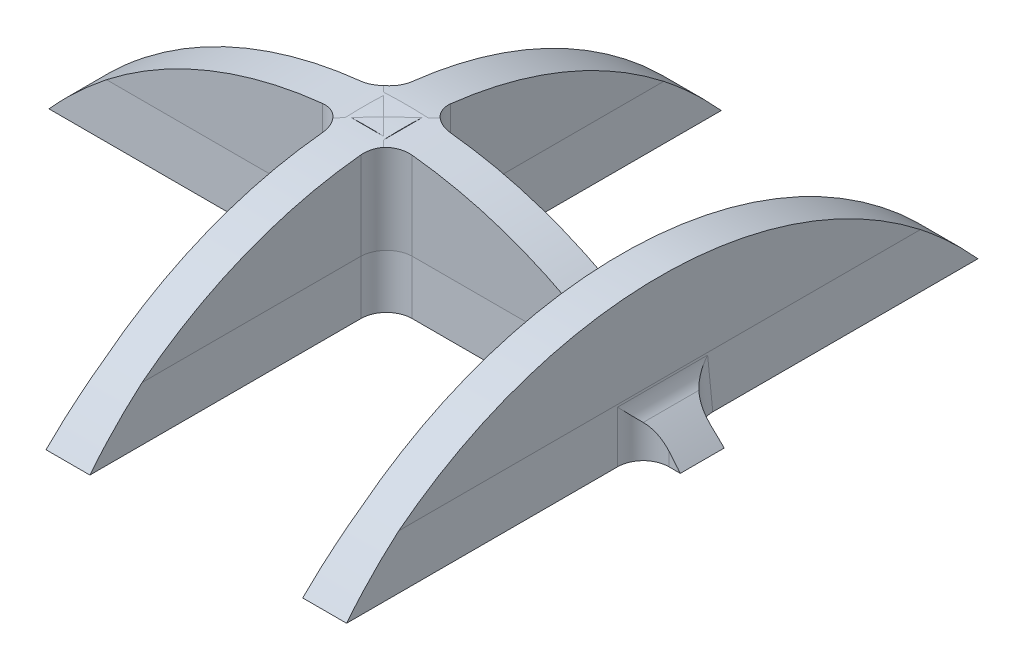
ISO-10303-21;
HEADER;
FILE_DESCRIPTION(('STEP AP214'),'2;1');
FILE_NAME('part.step','',(''),(''),'','','');
FILE_SCHEMA(('AUTOMOTIVE_DESIGN { 1 0 10303 214 1 1 1 1 }'));
ENDSEC;
DATA;
#1=APPLICATION_CONTEXT('core data for automotive mechanical design processes');
#2=APPLICATION_PROTOCOL_DEFINITION('international standard','automotive_design',2000,#1);
#3=PRODUCT_CONTEXT('',#1,'mechanical');
#4=PRODUCT('Part','Part','',(#3));
#5=PRODUCT_RELATED_PRODUCT_CATEGORY('part','',(#4));
#6=PRODUCT_DEFINITION_FORMATION('','',#4);
#7=PRODUCT_DEFINITION_CONTEXT('part definition',#1,'design');
#8=PRODUCT_DEFINITION('design','',#6,#7);
#9=PRODUCT_DEFINITION_SHAPE('','',#8);
#10=(LENGTH_UNIT() NAMED_UNIT(*) SI_UNIT(.MILLI.,.METRE.));
#11=(NAMED_UNIT(*) PLANE_ANGLE_UNIT() SI_UNIT($,.RADIAN.));
#12=(NAMED_UNIT(*) SI_UNIT($,.STERADIAN.) SOLID_ANGLE_UNIT());
#13=UNCERTAINTY_MEASURE_WITH_UNIT(LENGTH_MEASURE(1.E-05),#10,'distance_accuracy_value','');
#14=(GEOMETRIC_REPRESENTATION_CONTEXT(3) GLOBAL_UNCERTAINTY_ASSIGNED_CONTEXT((#13)) GLOBAL_UNIT_ASSIGNED_CONTEXT((#10,
#11,#12)) REPRESENTATION_CONTEXT('',''));
#15=CARTESIAN_POINT('',(0.,0.,0.));
#16=DIRECTION('',(0.,0.,1.));
#17=DIRECTION('',(1.,0.,0.));
#18=AXIS2_PLACEMENT_3D('',#15,#16,#17);
#19=CARTESIAN_POINT('',(-1.5,0.,0.226449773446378));
#20=DIRECTION('',(-1.,0.,0.));
#21=DIRECTION('',(0.,0.,1.));
#22=AXIS2_PLACEMENT_3D('',#19,#20,#21);
#23=PLANE('',#22);
#24=CARTESIAN_POINT('',(-1.5,0.,0.226449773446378));
#25=DIRECTION('',(-1.,0.,0.));
#26=DIRECTION('',(0.,0.,1.));
#27=AXIS2_PLACEMENT_3D('',#24,#25,#26);
#28=CIRCLE('',#27,33.);
#29=CARTESIAN_POINT('',(-1.5,26.,20.5488512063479));
#30=VERTEX_POINT('',#29);
#31=CARTESIAN_POINT('',(-1.5,32.8372329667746,3.5));
#32=VERTEX_POINT('',#31);
#33=EDGE_CURVE('E395',#30,#32,#28,.T.);
#34=ORIENTED_EDGE('',*,*,#33,.T.);
#35=DIRECTION('',(0.,-1.,0.));
#36=VECTOR('',#35,1.);
#37=CARTESIAN_POINT('',(-1.5,26.,3.5));
#38=LINE('',#37,#36);
#39=CARTESIAN_POINT('',(-1.5,26.,3.5));
#40=VERTEX_POINT('',#39);
#41=EDGE_CURVE('E576',#32,#40,#38,.T.);
#42=ORIENTED_EDGE('',*,*,#41,.T.);
#43=DIRECTION('',(0.,0.,-1.));
#44=VECTOR('',#43,1.);
#45=CARTESIAN_POINT('',(-1.5,26.,0.226449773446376));
#46=LINE('',#45,#44);
#47=EDGE_CURVE('E417',#30,#40,#46,.T.);
#48=ORIENTED_EDGE('',*,*,#47,.F.);
#49=EDGE_LOOP('',(#34,#42,#48));
#50=FACE_BOUND('',#49,.T.);
#51=ADVANCED_FACE('F31',(#50),#23,.T.);
#52=CARTESIAN_POINT('',(1.5,0.,0.226449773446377));
#53=DIRECTION('',(-1.,0.,0.));
#54=DIRECTION('',(0.,0.,1.));
#55=AXIS2_PLACEMENT_3D('',#52,#53,#54);
#56=PLANE('',#55);
#57=DIRECTION('',(0.,0.,-1.));
#58=VECTOR('',#57,1.);
#59=CARTESIAN_POINT('',(1.5,26.,0.226449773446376));
#60=LINE('',#59,#58);
#61=CARTESIAN_POINT('',(1.5,26.,20.5488512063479));
#62=VERTEX_POINT('',#61);
#63=CARTESIAN_POINT('',(1.5,26.,3.5));
#64=VERTEX_POINT('',#63);
#65=EDGE_CURVE('E428',#62,#64,#60,.T.);
#66=ORIENTED_EDGE('',*,*,#65,.T.);
#67=DIRECTION('',(0.,-1.,0.));
#68=VECTOR('',#67,1.);
#69=CARTESIAN_POINT('',(1.5,0.,3.5));
#70=LINE('',#69,#68);
#71=CARTESIAN_POINT('',(1.5,32.8372329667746,3.5));
#72=VERTEX_POINT('',#71);
#73=EDGE_CURVE('E563',#64,#72,#70,.F.);
#74=ORIENTED_EDGE('',*,*,#73,.T.);
#75=CARTESIAN_POINT('',(1.5,0.,0.226449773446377));
#76=DIRECTION('',(-1.,0.,0.));
#77=DIRECTION('',(0.,0.,1.));
#78=AXIS2_PLACEMENT_3D('',#75,#76,#77);
#79=CIRCLE('',#78,33.);
#80=EDGE_CURVE('E390',#62,#72,#79,.T.);
#81=ORIENTED_EDGE('',*,*,#80,.F.);
#82=EDGE_LOOP('',(#66,#74,#81));
#83=FACE_BOUND('',#82,.T.);
#84=ADVANCED_FACE('F679',(#83),#56,.F.);
#85=CARTESIAN_POINT('',(0.,0.,-1.5));
#86=DIRECTION('',(0.,0.,1.));
#87=DIRECTION('',(1.,0.,0.));
#88=AXIS2_PLACEMENT_3D('',#85,#86,#87);
#89=PLANE('',#88);
#90=CARTESIAN_POINT('',(0.,0.,-1.5));
#91=DIRECTION('',(0.,0.,1.));
#92=DIRECTION('',(1.,0.,0.));
#93=AXIS2_PLACEMENT_3D('',#90,#91,#92);
#94=CIRCLE('',#93,33.);
#95=CARTESIAN_POINT('',(15.5571428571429,29.1028401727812,-1.5));
#96=VERTEX_POINT('',#95);
#97=CARTESIAN_POINT('',(3.5,32.8138690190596,-1.5));
#98=VERTEX_POINT('',#97);
#99=EDGE_CURVE('E457',#96,#98,#94,.T.);
#100=ORIENTED_EDGE('',*,*,#99,.F.);
#101=CARTESIAN_POINT('',(16.5,30.8666486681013,-1.5));
#102=DIRECTION('',(0.,0.,1.));
#103=DIRECTION('',(1.,0.,0.));
#104=AXIS2_PLACEMENT_3D('',#101,#102,#103);
#105=CIRCLE('',#104,2.);
#106=CARTESIAN_POINT('',(16.5,28.8666486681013,-1.5));
#107=VERTEX_POINT('',#106);
#108=EDGE_CURVE('E630',#96,#107,#105,.T.);
#109=ORIENTED_EDGE('',*,*,#108,.T.);
#110=DIRECTION('',(0.,-1.,0.));
#111=VECTOR('',#110,1.);
#112=CARTESIAN_POINT('',(16.5,0.,-1.5));
#113=LINE('',#112,#111);
#114=CARTESIAN_POINT('',(16.5,26.,-1.5));
#115=VERTEX_POINT('',#114);
#116=EDGE_CURVE('E526',#107,#115,#113,.T.);
#117=ORIENTED_EDGE('',*,*,#116,.T.);
#118=DIRECTION('',(-1.,0.,0.));
#119=VECTOR('',#118,1.);
#120=CARTESIAN_POINT('',(0.,26.,-1.5));
#121=LINE('',#120,#119);
#122=CARTESIAN_POINT('',(3.5,26.,-1.5));
#123=VERTEX_POINT('',#122);
#124=EDGE_CURVE('E495',#115,#123,#121,.T.);
#125=ORIENTED_EDGE('',*,*,#124,.T.);
#126=DIRECTION('',(0.,-1.,0.));
#127=VECTOR('',#126,1.);
#128=CARTESIAN_POINT('',(3.5,32.9548080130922,-1.5));
#129=LINE('',#128,#127);
#130=EDGE_CURVE('E524',#123,#98,#129,.F.);
#131=ORIENTED_EDGE('',*,*,#130,.T.);
#132=EDGE_LOOP('',(#100,#109,#117,#125,#131));
#133=FACE_BOUND('',#132,.T.);
#134=ADVANCED_FACE('F688',(#133),#89,.F.);
#135=CARTESIAN_POINT('',(-3.5,32.8138690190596,-1.5));
#136=VERTEX_POINT('',#135);
#137=CARTESIAN_POINT('',(-20.3224014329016,26.,-1.5));
#138=VERTEX_POINT('',#137);
#139=EDGE_CURVE('E454',#136,#138,#94,.T.);
#140=ORIENTED_EDGE('',*,*,#139,.F.);
#141=DIRECTION('',(0.,-1.,0.));
#142=VECTOR('',#141,1.);
#143=CARTESIAN_POINT('',(-3.5,0.,-1.5));
#144=LINE('',#143,#142);
#145=CARTESIAN_POINT('',(-3.5,26.,-1.5));
#146=VERTEX_POINT('',#145);
#147=EDGE_CURVE('E522',#136,#146,#144,.T.);
#148=ORIENTED_EDGE('',*,*,#147,.T.);
#149=EDGE_CURVE('E491',#146,#138,#121,.T.);
#150=ORIENTED_EDGE('',*,*,#149,.T.);
#151=EDGE_LOOP('',(#140,#148,#150));
#152=FACE_BOUND('',#151,.T.);
#153=ADVANCED_FACE('F1054',(#152),#89,.F.);
#154=CARTESIAN_POINT('',(21.5,0.,0.226449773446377));
#155=DIRECTION('',(-1.,0.,0.));
#156=DIRECTION('',(0.,0.,1.));
#157=AXIS2_PLACEMENT_3D('',#154,#155,#156);
#158=PLANE('',#157);
#159=CARTESIAN_POINT('',(21.5,0.,0.226449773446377));
#160=DIRECTION('',(-1.,0.,0.));
#161=DIRECTION('',(0.,0.,1.));
#162=AXIS2_PLACEMENT_3D('',#159,#160,#161);
#163=CIRCLE('',#162,33.);
#164=CARTESIAN_POINT('',(21.5,26.,20.5488512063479));
#165=VERTEX_POINT('',#164);
#166=CARTESIAN_POINT('',(21.5,26.,-20.0959516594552));
#167=VERTEX_POINT('',#166);
#168=EDGE_CURVE('E381',#165,#167,#163,.T.);
#169=ORIENTED_EDGE('',*,*,#168,.F.);
#170=DIRECTION('',(0.,0.,-1.));
#171=VECTOR('',#170,1.);
#172=CARTESIAN_POINT('',(21.5,26.,0.226449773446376));
#173=LINE('',#172,#171);
#174=EDGE_CURVE('E377',#165,#167,#173,.T.);
#175=ORIENTED_EDGE('',*,*,#174,.T.);
#176=EDGE_LOOP('',(#169,#175));
#177=FACE_BOUND('',#176,.T.);
#178=ADVANCED_FACE('F621',(#177),#158,.F.);
#179=CARTESIAN_POINT('',(21.5,26.,0.226449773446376));
#180=DIRECTION('',(0.998629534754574,0.0523359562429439,0.));
#181=DIRECTION('',(-0.0523359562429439,0.998629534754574,0.));
#182=AXIS2_PLACEMENT_3D('',#179,#180,#181);
#183=PLANE('',#182);
#184=DIRECTION('',(0.,0.,-1.));
#185=VECTOR('',#184,1.);
#186=CARTESIAN_POINT('',(21.509065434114,25.8270212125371,-1.55296367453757));
#187=LINE('',#186,#185);
#188=CARTESIAN_POINT('',(21.509065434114,25.8270212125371,3.50632450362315));
#189=VERTEX_POINT('',#188);
#190=CARTESIAN_POINT('',(21.509065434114,25.8270212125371,-3.50632450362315));
#191=VERTEX_POINT('',#190);
#192=EDGE_CURVE('E449',#189,#191,#187,.T.);
#193=ORIENTED_EDGE('',*,*,#192,.T.);
#194=DIRECTION('',(-0.052264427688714,0.997264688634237,0.0522644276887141));
#195=VECTOR('',#194,1.);
#196=CARTESIAN_POINT('',(21.7041754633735,22.1041000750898,-3.70143453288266));
#197=LINE('',#196,#195);
#198=CARTESIAN_POINT('',(21.7096311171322,22.,-3.70689018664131));
#199=VERTEX_POINT('',#198);
#200=EDGE_CURVE('E500',#191,#199,#197,.F.);
#201=ORIENTED_EDGE('',*,*,#200,.T.);
#202=DIRECTION('',(0.,0.,-1.));
#203=VECTOR('',#202,1.);
#204=CARTESIAN_POINT('',(21.7096311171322,22.,-24.3702979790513));
#205=LINE('',#204,#203);
#206=CARTESIAN_POINT('',(21.7096311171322,22.,-24.3702979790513));
#207=VERTEX_POINT('',#206);
#208=EDGE_CURVE('E373',#207,#199,#205,.F.);
#209=ORIENTED_EDGE('',*,*,#208,.F.);
#210=CARTESIAN_POINT('',(22.8626022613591,0.,0.226449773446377));
#211=DIRECTION('',(0.998629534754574,0.0523359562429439,0.));
#212=DIRECTION('',(0.0523359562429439,-0.998629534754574,0.));
#213=AXIS2_PLACEMENT_3D('',#210,#211,#212);
#214=ELLIPSE('',#213,33.0452874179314,33.);
#215=EDGE_CURVE('E379',#167,#207,#214,.F.);
#216=ORIENTED_EDGE('',*,*,#215,.F.);
#217=ORIENTED_EDGE('',*,*,#174,.F.);
#218=CARTESIAN_POINT('',(22.8626022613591,0.,0.226449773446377));
#219=DIRECTION('',(0.998629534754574,0.0523359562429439,0.));
#220=DIRECTION('',(0.0523359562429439,-0.998629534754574,0.));
#221=AXIS2_PLACEMENT_3D('',#218,#219,#220);
#222=ELLIPSE('',#221,33.0452874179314,33.);
#223=CARTESIAN_POINT('',(21.7096311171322,22.,24.8231975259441));
#224=VERTEX_POINT('',#223);
#225=EDGE_CURVE('E385',#224,#165,#222,.F.);
#226=ORIENTED_EDGE('',*,*,#225,.F.);
#227=CARTESIAN_POINT('',(21.7096311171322,22.,3.70689018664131));
#228=VERTEX_POINT('',#227);
#229=EDGE_CURVE('E355',#228,#224,#205,.F.);
#230=ORIENTED_EDGE('',*,*,#229,.F.);
#231=DIRECTION('',(0.052264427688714,-0.997264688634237,0.0522644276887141));
#232=VECTOR('',#231,1.);
#233=CARTESIAN_POINT('',(21.4910655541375,26.1704793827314,3.48832462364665));
#234=LINE('',#233,#232);
#235=EDGE_CURVE('E498',#228,#189,#234,.F.);
#236=ORIENTED_EDGE('',*,*,#235,.T.);
#237=EDGE_LOOP('',(#193,#201,#209,#216,#217,#226,#230,#236));
#238=FACE_BOUND('',#237,.T.);
#239=ADVANCED_FACE('F819',(#238),#183,.T.);
#240=CARTESIAN_POINT('',(18.5,26.,0.226449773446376));
#241=DIRECTION('',(-0.998629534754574,0.0523359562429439,0.));
#242=DIRECTION('',(-0.0523359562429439,-0.998629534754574,0.));
#243=AXIS2_PLACEMENT_3D('',#240,#241,#242);
#244=PLANE('',#243);
#245=DIRECTION('',(0.,0.,1.));
#246=VECTOR('',#245,1.);
#247=CARTESIAN_POINT('',(18.2903688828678,22.,-24.3702979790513));
#248=LINE('',#247,#246);
#249=CARTESIAN_POINT('',(18.2903688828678,22.,-24.3702979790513));
#250=VERTEX_POINT('',#249);
#251=CARTESIAN_POINT('',(18.2903688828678,22.,-3.70689018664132));
#252=VERTEX_POINT('',#251);
#253=EDGE_CURVE('E348',#250,#252,#248,.T.);
#254=ORIENTED_EDGE('',*,*,#253,.T.);
#255=DIRECTION('',(0.052264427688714,0.997264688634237,0.0522644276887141));
#256=VECTOR('',#255,1.);
#257=CARTESIAN_POINT('',(18.5101715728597,26.1940851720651,-3.48708749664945));
#258=LINE('',#257,#256);
#259=CARTESIAN_POINT('',(18.4999981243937,25.9999642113,-3.49726094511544));
#260=VERTEX_POINT('',#259);
#261=EDGE_CURVE('E520',#252,#260,#258,.T.);
#262=ORIENTED_EDGE('',*,*,#261,.T.);
#263=CARTESIAN_POINT('',(16.5,-12.1622733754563,-3.5));
#264=DIRECTION('',(-0.998629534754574,0.0523359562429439,0.));
#265=DIRECTION('',(-0.052335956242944,-0.998629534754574,0.));
#266=AXIS2_PLACEMENT_3D('',#263,#264,#265);
#267=ELLIPSE('',#266,38.2146452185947,2.);
#268=CARTESIAN_POINT('',(18.5,26.,-3.5));
#269=VERTEX_POINT('',#268);
#270=EDGE_CURVE('E518',#260,#269,#267,.T.);
#271=ORIENTED_EDGE('',*,*,#270,.T.);
#272=DIRECTION('',(0.,0.,-1.));
#273=VECTOR('',#272,1.);
#274=CARTESIAN_POINT('',(18.5,26.,0.226449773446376));
#275=LINE('',#274,#273);
#276=CARTESIAN_POINT('',(18.5,26.,-20.0959516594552));
#277=VERTEX_POINT('',#276);
#278=EDGE_CURVE('E378',#269,#277,#275,.T.);
#279=ORIENTED_EDGE('',*,*,#278,.T.);
#280=CARTESIAN_POINT('',(17.1373977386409,0.,0.226449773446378));
#281=DIRECTION('',(-0.998629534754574,0.0523359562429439,0.));
#282=DIRECTION('',(0.0523359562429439,0.998629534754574,0.));
#283=AXIS2_PLACEMENT_3D('',#280,#281,#282);
#284=ELLIPSE('',#283,33.0452874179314,33.);
#285=EDGE_CURVE('E367',#277,#250,#284,.T.);
#286=ORIENTED_EDGE('',*,*,#285,.T.);
#287=EDGE_LOOP('',(#254,#262,#271,#279,#286));
#288=FACE_BOUND('',#287,.T.);
#289=ADVANCED_FACE('F786',(#288),#244,.T.);
#290=CARTESIAN_POINT('',(18.5,0.,0.226449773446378));
#291=DIRECTION('',(1.,0.,0.));
#292=DIRECTION('',(0.,0.,-1.));
#293=AXIS2_PLACEMENT_3D('',#290,#291,#292);
#294=CYLINDRICAL_SURFACE('',#293,33.);
#295=ORIENTED_EDGE('',*,*,#225,.T.);
#296=ORIENTED_EDGE('',*,*,#168,.T.);
#297=ORIENTED_EDGE('',*,*,#215,.T.);
#298=DIRECTION('',(1.,0.,0.));
#299=VECTOR('',#298,1.);
#300=CARTESIAN_POINT('',(18.5,22.,-24.3702979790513));
#301=LINE('',#300,#299);
#302=EDGE_CURVE('E359',#250,#207,#301,.T.);
#303=ORIENTED_EDGE('',*,*,#302,.F.);
#304=ORIENTED_EDGE('',*,*,#285,.F.);
#305=CARTESIAN_POINT('',(18.5,0.,0.226449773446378));
#306=DIRECTION('',(-1.,0.,0.));
#307=DIRECTION('',(0.,0.,1.));
#308=AXIS2_PLACEMENT_3D('',#305,#306,#307);
#309=CIRCLE('',#308,33.);
#310=CARTESIAN_POINT('',(18.5,26.,20.5488512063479));
#311=VERTEX_POINT('',#310);
#312=EDGE_CURVE('E365',#311,#277,#309,.T.);
#313=ORIENTED_EDGE('',*,*,#312,.F.);
#314=CARTESIAN_POINT('',(17.1373977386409,0.,0.226449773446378));
#315=DIRECTION('',(-0.998629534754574,0.0523359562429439,0.));
#316=DIRECTION('',(0.0523359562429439,0.998629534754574,0.));
#317=AXIS2_PLACEMENT_3D('',#314,#315,#316);
#318=ELLIPSE('',#317,33.0452874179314,33.);
#319=CARTESIAN_POINT('',(18.2903688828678,22.,24.8231975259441));
#320=VERTEX_POINT('',#319);
#321=EDGE_CURVE('E343',#320,#311,#318,.T.);
#322=ORIENTED_EDGE('',*,*,#321,.F.);
#323=DIRECTION('',(1.,0.,0.));
#324=VECTOR('',#323,1.);
#325=CARTESIAN_POINT('',(18.5,22.,24.8231975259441));
#326=LINE('',#325,#324);
#327=EDGE_CURVE('E351',#320,#224,#326,.T.);
#328=ORIENTED_EDGE('',*,*,#327,.T.);
#329=EDGE_LOOP('',(#295,#296,#297,#303,#304,#313,#322,#328));
#330=FACE_BOUND('',#329,.T.);
#331=ADVANCED_FACE('F362',(#330),#294,.T.);
#332=CARTESIAN_POINT('',(18.5,26.,3.5));
#333=VERTEX_POINT('',#332);
#334=EDGE_CURVE('E374',#311,#333,#275,.T.);
#335=ORIENTED_EDGE('',*,*,#334,.T.);
#336=CARTESIAN_POINT('',(16.5,-12.1622733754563,3.5));
#337=DIRECTION('',(-0.998629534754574,0.0523359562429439,0.));
#338=DIRECTION('',(0.052335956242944,0.998629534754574,0.));
#339=AXIS2_PLACEMENT_3D('',#336,#337,#338);
#340=ELLIPSE('',#339,38.2146452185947,2.);
#341=CARTESIAN_POINT('',(18.4999981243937,25.9999642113,3.49726094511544));
#342=VERTEX_POINT('',#341);
#343=EDGE_CURVE('E537',#333,#342,#340,.T.);
#344=ORIENTED_EDGE('',*,*,#343,.T.);
#345=DIRECTION('',(-0.052264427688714,-0.997264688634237,0.052264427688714));
#346=VECTOR('',#345,1.);
#347=CARTESIAN_POINT('',(18.2958245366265,22.1041000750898,3.70143453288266));
#348=LINE('',#347,#346);
#349=CARTESIAN_POINT('',(18.2903688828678,22.,3.70689018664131));
#350=VERTEX_POINT('',#349);
#351=EDGE_CURVE('E345',#342,#350,#348,.T.);
#352=ORIENTED_EDGE('',*,*,#351,.T.);
#353=EDGE_CURVE('E338',#350,#320,#248,.T.);
#354=ORIENTED_EDGE('',*,*,#353,.T.);
#355=ORIENTED_EDGE('',*,*,#321,.T.);
#356=EDGE_LOOP('',(#335,#344,#352,#354,#355));
#357=FACE_BOUND('',#356,.T.);
#358=ADVANCED_FACE('F341',(#357),#244,.T.);
#359=CARTESIAN_POINT('',(18.5,0.,0.226449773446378));
#360=DIRECTION('',(-1.,0.,0.));
#361=DIRECTION('',(0.,0.,1.));
#362=AXIS2_PLACEMENT_3D('',#359,#360,#361);
#363=PLANE('',#362);
#364=ORIENTED_EDGE('',*,*,#278,.F.);
#365=DIRECTION('',(0.,-1.,0.));
#366=VECTOR('',#365,1.);
#367=CARTESIAN_POINT('',(18.5,0.,-3.5));
#368=LINE('',#367,#366);
#369=CARTESIAN_POINT('',(18.5,30.8666486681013,-3.5));
#370=VERTEX_POINT('',#369);
#371=EDGE_CURVE('E532',#269,#370,#368,.F.);
#372=ORIENTED_EDGE('',*,*,#371,.T.);
#373=DIRECTION('',(0.,0.,-1.));
#374=VECTOR('',#373,1.);
#375=CARTESIAN_POINT('',(18.5,30.8666486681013,0.226449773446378));
#376=LINE('',#375,#374);
#377=CARTESIAN_POINT('',(18.5,30.8666486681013,3.5));
#378=VERTEX_POINT('',#377);
#379=EDGE_CURVE('E530',#370,#378,#376,.F.);
#380=ORIENTED_EDGE('',*,*,#379,.T.);
#381=DIRECTION('',(0.,-1.,0.));
#382=VECTOR('',#381,1.);
#383=CARTESIAN_POINT('',(18.5,26.,3.5));
#384=LINE('',#383,#382);
#385=EDGE_CURVE('E528',#378,#333,#384,.T.);
#386=ORIENTED_EDGE('',*,*,#385,.T.);
#387=ORIENTED_EDGE('',*,*,#334,.F.);
#388=ORIENTED_EDGE('',*,*,#312,.T.);
#389=EDGE_LOOP('',(#364,#372,#380,#386,#387,#388));
#390=FACE_BOUND('',#389,.T.);
#391=ADVANCED_FACE('F790',(#390),#363,.T.);
#392=CARTESIAN_POINT('',(0.,26.,1.5));
#393=DIRECTION('',(0.,0.0523359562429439,0.998629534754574));
#394=DIRECTION('',(0.,-0.998629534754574,0.0523359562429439));
#395=AXIS2_PLACEMENT_3D('',#392,#393,#394);
#396=PLANE('',#395);
#397=DIRECTION('',(-0.052264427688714,-0.997264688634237,0.052264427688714));
#398=VECTOR('',#397,1.);
#399=CARTESIAN_POINT('',(-3.49180341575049,26.1041000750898,1.49454434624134));
#400=LINE('',#399,#398);
#401=CARTESIAN_POINT('',(-3.70689018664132,22.,1.70963111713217));
#402=VERTEX_POINT('',#401);
#403=CARTESIAN_POINT('',(-3.49726094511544,25.9999642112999,1.50000187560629));
#404=VERTEX_POINT('',#403);
#405=EDGE_CURVE('E582',#402,#404,#400,.F.);
#406=ORIENTED_EDGE('',*,*,#405,.T.);
#407=CARTESIAN_POINT('',(-3.5,-12.1622733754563,3.5));
#408=DIRECTION('',(0.,0.0523359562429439,0.998629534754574));
#409=DIRECTION('',(0.,0.998629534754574,-0.052335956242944));
#410=AXIS2_PLACEMENT_3D('',#407,#408,#409);
#411=ELLIPSE('',#410,38.2146452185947,2.);
#412=CARTESIAN_POINT('',(-3.5,26.,1.5));
#413=VERTEX_POINT('',#412);
#414=EDGE_CURVE('E584',#404,#413,#411,.T.);
#415=ORIENTED_EDGE('',*,*,#414,.T.);
#416=DIRECTION('',(-1.,0.,0.));
#417=VECTOR('',#416,1.);
#418=CARTESIAN_POINT('',(0.,26.,1.5));
#419=LINE('',#418,#417);
#420=CARTESIAN_POINT('',(-20.3224014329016,26.,1.5));
#421=VERTEX_POINT('',#420);
#422=EDGE_CURVE('E467',#413,#421,#419,.T.);
#423=ORIENTED_EDGE('',*,*,#422,.T.);
#424=CARTESIAN_POINT('',(0.,0.,2.86260226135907));
#425=DIRECTION('',(0.,0.0523359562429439,0.998629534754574));
#426=DIRECTION('',(0.,0.998629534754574,-0.0523359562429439));
#427=AXIS2_PLACEMENT_3D('',#424,#425,#426);
#428=ELLIPSE('',#427,33.0452874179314,33.);
#429=CARTESIAN_POINT('',(-24.5967477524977,22.,1.70963111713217));
#430=VERTEX_POINT('',#429);
#431=EDGE_CURVE('E462',#421,#430,#428,.T.);
#432=ORIENTED_EDGE('',*,*,#431,.T.);
#433=DIRECTION('',(1.,0.,0.));
#434=VECTOR('',#433,1.);
#435=CARTESIAN_POINT('',(-24.5967477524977,22.,1.70963111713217));
#436=LINE('',#435,#434);
#437=EDGE_CURVE('E471',#430,#402,#436,.T.);
#438=ORIENTED_EDGE('',*,*,#437,.T.);
#439=EDGE_LOOP('',(#406,#415,#423,#432,#438));
#440=FACE_BOUND('',#439,.T.);
#441=ADVANCED_FACE('F1063',(#440),#396,.T.);
#442=DIRECTION('',(-0.052264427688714,-0.997264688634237,0.052264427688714));
#443=VECTOR('',#442,1.);
#444=CARTESIAN_POINT('',(16.5081965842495,26.1041000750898,1.49454434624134));
#445=LINE('',#444,#443);
#446=CARTESIAN_POINT('',(16.2931098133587,22.,1.70963111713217));
#447=VERTEX_POINT('',#446);
#448=CARTESIAN_POINT('',(16.5027390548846,25.9999642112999,1.50000187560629));
#449=VERTEX_POINT('',#448);
#450=EDGE_CURVE('E544',#447,#449,#445,.F.);
#451=ORIENTED_EDGE('',*,*,#450,.T.);
#452=CARTESIAN_POINT('',(16.5,-12.1622733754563,3.5));
#453=DIRECTION('',(0.,0.0523359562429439,0.998629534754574));
#454=DIRECTION('',(0.,0.998629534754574,-0.052335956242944));
#455=AXIS2_PLACEMENT_3D('',#452,#453,#454);
#456=ELLIPSE('',#455,38.2146452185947,2.);
#457=CARTESIAN_POINT('',(16.5,26.,1.5));
#458=VERTEX_POINT('',#457);
#459=EDGE_CURVE('E546',#449,#458,#456,.T.);
#460=ORIENTED_EDGE('',*,*,#459,.T.);
#461=CARTESIAN_POINT('',(3.5,26.,1.5));
#462=VERTEX_POINT('',#461);
#463=EDGE_CURVE('E483',#458,#462,#419,.T.);
#464=ORIENTED_EDGE('',*,*,#463,.T.);
#465=CARTESIAN_POINT('',(3.5,-12.1622733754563,3.5));
#466=DIRECTION('',(0.,0.0523359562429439,0.998629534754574));
#467=DIRECTION('',(0.,-0.998629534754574,0.052335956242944));
#468=AXIS2_PLACEMENT_3D('',#465,#466,#467);
#469=ELLIPSE('',#468,38.2146452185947,2.);
#470=CARTESIAN_POINT('',(3.49726094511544,25.9999642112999,1.50000187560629));
#471=VERTEX_POINT('',#470);
#472=EDGE_CURVE('E539',#462,#471,#469,.T.);
#473=ORIENTED_EDGE('',*,*,#472,.T.);
#474=DIRECTION('',(-0.0522644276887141,0.997264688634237,-0.052264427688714));
#475=VECTOR('',#474,1.);
#476=CARTESIAN_POINT('',(3.48770606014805,26.1822822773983,1.4904469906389));
#477=LINE('',#476,#475);
#478=CARTESIAN_POINT('',(3.70689018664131,22.,1.70963111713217));
#479=VERTEX_POINT('',#478);
#480=EDGE_CURVE('E541',#471,#479,#477,.F.);
#481=ORIENTED_EDGE('',*,*,#480,.T.);
#482=EDGE_CURVE('E478',#479,#447,#436,.T.);
#483=ORIENTED_EDGE('',*,*,#482,.T.);
#484=EDGE_LOOP('',(#451,#460,#464,#473,#481,#483));
#485=FACE_BOUND('',#484,.T.);
#486=ADVANCED_FACE('F800',(#485),#396,.T.);
#487=CARTESIAN_POINT('',(0.,26.,-1.5));
#488=DIRECTION('',(0.,0.0523359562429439,-0.998629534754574));
#489=DIRECTION('',(0.,0.998629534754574,0.0523359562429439));
#490=AXIS2_PLACEMENT_3D('',#487,#488,#489);
#491=PLANE('',#490);
#492=CARTESIAN_POINT('',(16.5,-12.1622733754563,-3.5));
#493=DIRECTION('',(0.,0.0523359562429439,-0.998629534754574));
#494=DIRECTION('',(0.,-0.998629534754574,-0.052335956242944));
#495=AXIS2_PLACEMENT_3D('',#492,#493,#494);
#496=ELLIPSE('',#495,38.2146452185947,2.);
#497=CARTESIAN_POINT('',(16.5027390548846,25.9999642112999,-1.50000187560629));
#498=VERTEX_POINT('',#497);
#499=EDGE_CURVE('E513',#115,#498,#496,.T.);
#500=ORIENTED_EDGE('',*,*,#499,.T.);
#501=DIRECTION('',(-0.0522644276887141,-0.997264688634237,-0.052264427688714));
#502=VECTOR('',#501,1.);
#503=CARTESIAN_POINT('',(16.4576625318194,25.1398529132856,-1.54507839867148));
#504=LINE('',#503,#502);
#505=CARTESIAN_POINT('',(16.2931098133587,22.,-1.70963111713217));
#506=VERTEX_POINT('',#505);
#507=EDGE_CURVE('E515',#498,#506,#504,.T.);
#508=ORIENTED_EDGE('',*,*,#507,.T.);
#509=DIRECTION('',(-1.,0.,0.));
#510=VECTOR('',#509,1.);
#511=CARTESIAN_POINT('',(-24.5967477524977,22.,-1.70963111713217));
#512=LINE('',#511,#510);
#513=CARTESIAN_POINT('',(3.70689018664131,22.,-1.70963111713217));
#514=VERTEX_POINT('',#513);
#515=EDGE_CURVE('E486',#514,#506,#512,.F.);
#516=ORIENTED_EDGE('',*,*,#515,.F.);
#517=DIRECTION('',(-0.052264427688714,0.997264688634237,0.052264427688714));
#518=VECTOR('',#517,1.);
#519=CARTESIAN_POINT('',(3.49180341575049,26.1041000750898,-1.49454434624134));
#520=LINE('',#519,#518);
#521=CARTESIAN_POINT('',(3.49726094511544,25.9999642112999,-1.50000187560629));
#522=VERTEX_POINT('',#521);
#523=EDGE_CURVE('E511',#514,#522,#520,.T.);
#524=ORIENTED_EDGE('',*,*,#523,.T.);
#525=CARTESIAN_POINT('',(3.5,-12.1622733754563,-3.5));
#526=DIRECTION('',(0.,0.0523359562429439,-0.998629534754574));
#527=DIRECTION('',(0.,0.998629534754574,0.052335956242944));
#528=AXIS2_PLACEMENT_3D('',#525,#526,#527);
#529=ELLIPSE('',#528,38.2146452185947,2.);
#530=EDGE_CURVE('E509',#522,#123,#529,.T.);
#531=ORIENTED_EDGE('',*,*,#530,.T.);
#532=ORIENTED_EDGE('',*,*,#124,.F.);
#533=EDGE_LOOP('',(#500,#508,#516,#524,#531,#532));
#534=FACE_BOUND('',#533,.T.);
#535=ADVANCED_FACE('F831',(#534),#491,.T.);
#536=CARTESIAN_POINT('',(0.,0.,1.5));
#537=DIRECTION('',(0.,0.,-1.));
#538=DIRECTION('',(-1.,0.,0.));
#539=AXIS2_PLACEMENT_3D('',#536,#537,#538);
#540=CYLINDRICAL_SURFACE('',#539,33.);
#541=CARTESIAN_POINT('',(0.,0.,1.5));
#542=DIRECTION('',(0.,0.,1.));
#543=DIRECTION('',(1.,0.,0.));
#544=AXIS2_PLACEMENT_3D('',#541,#542,#543);
#545=CIRCLE('',#544,33.);
#546=CARTESIAN_POINT('',(15.5571428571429,29.1028401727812,1.5));
#547=VERTEX_POINT('',#546);
#548=CARTESIAN_POINT('',(3.5,32.8138690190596,1.5));
#549=VERTEX_POINT('',#548);
#550=EDGE_CURVE('E463',#547,#549,#545,.T.);
#551=ORIENTED_EDGE('',*,*,#550,.F.);
#552=DIRECTION('',(0.,0.,-1.));
#553=VECTOR('',#552,1.);
#554=CARTESIAN_POINT('',(15.5571428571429,29.1028401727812,1.5));
#555=LINE('',#554,#553);
#556=EDGE_CURVE('E534',#547,#96,#555,.T.);
#557=ORIENTED_EDGE('',*,*,#556,.T.);
#558=ORIENTED_EDGE('',*,*,#99,.T.);
#559=CARTESIAN_POINT('',(3.5,32.8138690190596,-1.5));
#560=CARTESIAN_POINT('',(3.44376738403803,32.8198677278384,-1.50000037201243));
#561=CARTESIAN_POINT('',(3.38754533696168,32.8257173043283,-1.50237305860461));
#562=CARTESIAN_POINT('',(3.27546893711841,32.8370898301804,-1.51184714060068));
#563=CARTESIAN_POINT('',(3.21961457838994,32.84261278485,-1.51894845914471));
#564=CARTESIAN_POINT('',(3.05337237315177,32.8586251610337,-1.54727860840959));
#565=CARTESIAN_POINT('',(2.94404665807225,32.8685856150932,-1.57553382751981));
#566=CARTESIAN_POINT('',(2.73152974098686,32.886929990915,-1.65009176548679));
#567=CARTESIAN_POINT('',(2.62834449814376,32.8953123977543,-1.69641169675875));
#568=CARTESIAN_POINT('',(2.4311580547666,32.9104733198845,-1.80580762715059));
#569=CARTESIAN_POINT('',(2.33715587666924,32.9172520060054,-1.86888184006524));
#570=CARTESIAN_POINT('',(2.16142996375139,32.9292568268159,-2.00975185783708));
#571=CARTESIAN_POINT('',(2.07965298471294,32.9344897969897,-2.08748027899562));
#572=CARTESIAN_POINT('',(1.96760849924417,32.9413103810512,-2.21354757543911));
#573=CARTESIAN_POINT('',(1.93199076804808,32.9434145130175,-2.25721266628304));
#574=CARTESIAN_POINT('',(1.86455402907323,32.9472999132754,-2.34740119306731));
#575=CARTESIAN_POINT('',(1.83273523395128,32.9490811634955,-2.39392478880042));
#576=CARTESIAN_POINT('',(1.80292130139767,32.9507128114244,-2.44173543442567));
#577=B_SPLINE_CURVE_WITH_KNOTS('',3,(#559,#560,#561,#562,#563,#564,#565,#566,#567,#568,#569,
#570,#571,#572,#573,#574,#575,#576),.UNSPECIFIED.,.F.,.F.,(4,2,2,2,2,2,2,2,4),(0.,
0.169552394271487,0.339102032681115,0.677430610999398,1.01608234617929,1.35469799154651,
1.69179298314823,1.86078457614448,2.02978562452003),.UNSPECIFIED.);
#578=CARTESIAN_POINT('',(2.20355112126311,32.926347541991,-1.97710134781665));
#579=VERTEX_POINT('',#578);
#580=EDGE_CURVE('E55',#98,#579,#577,.T.);
#581=ORIENTED_EDGE('',*,*,#580,.T.);
#582=CARTESIAN_POINT('',(0.,0.,0.226449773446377));
#583=DIRECTION('',(-0.707106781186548,0.,-0.707106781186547));
#584=DIRECTION('',(0.707106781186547,0.,-0.707106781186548));
#585=AXIS2_PLACEMENT_3D('',#582,#583,#584);
#586=ELLIPSE('',#585,46.6690475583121,33.);
#587=CARTESIAN_POINT('',(1.72644977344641,32.9548080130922,-1.5));
#588=VERTEX_POINT('',#587);
#589=EDGE_CURVE('E40',#588,#579,#586,.T.);
#590=ORIENTED_EDGE('',*,*,#589,.F.);
#591=CARTESIAN_POINT('',(-1.72644977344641,32.9548080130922,-1.5));
#592=VERTEX_POINT('',#591);
#593=EDGE_CURVE('E456',#588,#592,#94,.T.);
#594=ORIENTED_EDGE('',*,*,#593,.T.);
#595=CARTESIAN_POINT('',(0.,0.,0.226449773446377));
#596=DIRECTION('',(0.707106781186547,0.,-0.707106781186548));
#597=DIRECTION('',(-0.707106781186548,0.,-0.707106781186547));
#598=AXIS2_PLACEMENT_3D('',#595,#596,#597);
#599=ELLIPSE('',#598,46.6690475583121,33.);
#600=CARTESIAN_POINT('',(-2.20355112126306,32.926347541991,-1.97710134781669));
#601=VERTEX_POINT('',#600);
#602=EDGE_CURVE('E721',#592,#601,#599,.F.);
#603=ORIENTED_EDGE('',*,*,#602,.T.);
#604=CARTESIAN_POINT('',(-1.95325267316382,32.9421432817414,-2.23209909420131));
#605=CARTESIAN_POINT('',(-1.9888570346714,32.9400320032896,-2.18866508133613));
#606=CARTESIAN_POINT('',(-2.02627018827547,32.9377558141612,-2.14675708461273));
#607=CARTESIAN_POINT('',(-2.10447214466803,32.9328519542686,-2.06624445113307));
#608=CARTESIAN_POINT('',(-2.14526081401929,32.9302242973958,-2.02763968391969));
#609=CARTESIAN_POINT('',(-2.27220050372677,32.9217900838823,-1.91726625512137));
#610=CARTESIAN_POINT('',(-2.363036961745,32.9154258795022,-1.85080244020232));
#611=CARTESIAN_POINT('',(-2.5545388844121,32.9011179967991,-1.73400946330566));
#612=CARTESIAN_POINT('',(-2.65521817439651,32.8931720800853,-1.68370343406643));
#613=CARTESIAN_POINT('',(-2.8634181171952,32.8757009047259,-1.60071294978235));
#614=CARTESIAN_POINT('',(-2.97093261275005,32.8661770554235,-1.56801287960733));
#615=CARTESIAN_POINT('',(-3.14929132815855,32.8494563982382,-1.52972107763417));
#616=CARTESIAN_POINT('',(-3.21903635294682,32.8426967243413,-1.51857945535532));
#617=CARTESIAN_POINT('',(-3.35918605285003,32.8286592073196,-1.50371974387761));
#618=CARTESIAN_POINT('',(-3.42958995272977,32.8213819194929,-1.49999381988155));
#619=CARTESIAN_POINT('',(-3.5,32.8138690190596,-1.5));
#620=B_SPLINE_CURVE_WITH_KNOTS('',3,(#604,#605,#606,#607,#608,#609,#610,#611,#612,#613,#614,
#615,#616,#617,#618,#619),.UNSPECIFIED.,.F.,.F.,(4,2,2,2,2,2,2,4),(0.,0.168501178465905,
0.336995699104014,0.673462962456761,1.01040981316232,1.34705732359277,1.55955099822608,
1.77182005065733),.UNSPECIFIED.);
#621=EDGE_CURVE('E961',#601,#136,#620,.T.);
#622=ORIENTED_EDGE('',*,*,#621,.T.);
#623=ORIENTED_EDGE('',*,*,#139,.T.);
#624=CARTESIAN_POINT('',(0.,0.,-2.86260226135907));
#625=DIRECTION('',(0.,0.0523359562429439,-0.998629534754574));
#626=DIRECTION('',(0.,-0.998629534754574,-0.0523359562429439));
#627=AXIS2_PLACEMENT_3D('',#624,#625,#626);
#628=ELLIPSE('',#627,33.0452874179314,33.);
#629=CARTESIAN_POINT('',(-24.5967477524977,22.,-1.70963111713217));
#630=VERTEX_POINT('',#629);
#631=EDGE_CURVE('E432',#138,#630,#628,.F.);
#632=ORIENTED_EDGE('',*,*,#631,.T.);
#633=DIRECTION('',(0.,0.,-1.));
#634=VECTOR('',#633,1.);
#635=CARTESIAN_POINT('',(-24.5967477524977,22.,1.5));
#636=LINE('',#635,#634);
#637=EDGE_CURVE('E464',#430,#630,#636,.T.);
#638=ORIENTED_EDGE('',*,*,#637,.F.);
#639=ORIENTED_EDGE('',*,*,#431,.F.);
#640=CARTESIAN_POINT('',(-3.5,32.8138690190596,1.5));
#641=VERTEX_POINT('',#640);
#642=EDGE_CURVE('E458',#641,#421,#545,.T.);
#643=ORIENTED_EDGE('',*,*,#642,.F.);
#644=CARTESIAN_POINT('',(-3.5,32.8138690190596,1.5));
#645=CARTESIAN_POINT('',(-3.44378956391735,32.8198653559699,1.50000048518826));
#646=CARTESIAN_POINT('',(-3.38758983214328,32.8257126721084,1.5023712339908));
#647=CARTESIAN_POINT('',(-3.27555765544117,32.8370809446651,1.51183770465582));
#648=CARTESIAN_POINT('',(-3.21972520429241,32.8426019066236,1.51893334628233));
#649=CARTESIAN_POINT('',(-3.05345910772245,32.8586172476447,1.54725639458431));
#650=CARTESIAN_POINT('',(-2.94408809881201,32.8685820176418,1.57552003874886));
#651=CARTESIAN_POINT('',(-2.73152271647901,32.8869306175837,1.65009347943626));
#652=CARTESIAN_POINT('',(-2.62833228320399,32.895313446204,1.69641464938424));
#653=CARTESIAN_POINT('',(-2.43114181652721,32.9104744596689,1.80582045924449));
#654=CARTESIAN_POINT('',(-2.33713948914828,32.9172530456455,1.86890090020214));
#655=CARTESIAN_POINT('',(-2.16137156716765,32.9292608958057,2.00979276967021));
#656=CARTESIAN_POINT('',(-2.07956265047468,32.934495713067,2.08754970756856));
#657=CARTESIAN_POINT('',(-1.93011602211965,32.9435922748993,2.25576469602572));
#658=CARTESIAN_POINT('',(-1.86248121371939,32.9474537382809,2.34622534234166));
#659=CARTESIAN_POINT('',(-1.74347572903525,32.9539656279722,2.53706217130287));
#660=CARTESIAN_POINT('',(-1.69207407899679,32.9566183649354,2.6374189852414));
#661=CARTESIAN_POINT('',(-1.60685168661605,32.9608837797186,2.84533036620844));
#662=CARTESIAN_POINT('',(-1.5730204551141,32.9624970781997,2.95288059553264));
#663=CARTESIAN_POINT('',(-1.53234912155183,32.9644075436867,3.13424529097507));
#664=CARTESIAN_POINT('',(-1.52022554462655,32.964966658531,3.20691621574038));
#665=CARTESIAN_POINT('',(-1.50405207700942,32.9657071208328,3.35304791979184));
#666=CARTESIAN_POINT('',(-1.49999071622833,32.9658890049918,3.42650742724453));
#667=CARTESIAN_POINT('',(-1.5,32.9658914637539,3.5));
#668=B_SPLINE_CURVE_WITH_KNOTS('',3,(#644,#645,#646,#647,#648,#649,#650,#651,#652,#653,#654,
#655,#656,#657,#658,#659,#660,#661,#662,#663,#664,#665,#666,#667),.UNSPECIFIED.,.F.,.F.,(4,2,2,
2,2,2,2,2,2,2,2,4),(0.,0.169485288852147,0.338967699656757,0.677430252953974,1.01610633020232,
1.35469763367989,1.69205570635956,2.02948281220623,2.3662621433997,2.70284019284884,
2.92345523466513,3.14375618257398),.UNSPECIFIED.);
#669=CARTESIAN_POINT('',(-1.97710134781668,32.9407205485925,2.20355112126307));
#670=VERTEX_POINT('',#669);
#671=EDGE_CURVE('E718',#641,#670,#668,.T.);
#672=ORIENTED_EDGE('',*,*,#671,.T.);
#673=CARTESIAN_POINT('',(0.,0.,0.226449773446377));
#674=DIRECTION('',(0.707106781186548,0.,0.707106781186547));
#675=DIRECTION('',(0.707106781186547,0.,-0.707106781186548));
#676=AXIS2_PLACEMENT_3D('',#673,#674,#675);
#677=ELLIPSE('',#676,46.6690475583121,33.);
#678=CARTESIAN_POINT('',(-1.5,32.9658914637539,1.7264497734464));
#679=VERTEX_POINT('',#678);
#680=EDGE_CURVE('E35',#679,#670,#677,.T.);
#681=ORIENTED_EDGE('',*,*,#680,.F.);
#682=DIRECTION('',(0.,0.,-1.));
#683=VECTOR('',#682,1.);
#684=CARTESIAN_POINT('',(-1.5,32.9658914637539,1.5));
#685=LINE('',#684,#683);
#686=CARTESIAN_POINT('',(-1.5,32.9658914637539,-1.27355022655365));
#687=VERTEX_POINT('',#686);
#688=EDGE_CURVE('E438',#679,#687,#685,.T.);
#689=ORIENTED_EDGE('',*,*,#688,.T.);
#690=CARTESIAN_POINT('',(0.,0.,0.226449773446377));
#691=DIRECTION('',(0.707106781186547,0.,-0.707106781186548));
#692=DIRECTION('',(-0.707106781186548,0.,-0.707106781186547));
#693=AXIS2_PLACEMENT_3D('',#690,#691,#692);
#694=ELLIPSE('',#693,46.6690475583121,33.);
#695=CARTESIAN_POINT('',(0.,33.,0.226449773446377));
#696=VERTEX_POINT('',#695);
#697=EDGE_CURVE('E441',#696,#687,#694,.F.);
#698=ORIENTED_EDGE('',*,*,#697,.F.);
#699=CARTESIAN_POINT('',(0.,0.,0.226449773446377));
#700=DIRECTION('',(-0.707106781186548,0.,-0.707106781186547));
#701=DIRECTION('',(0.707106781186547,0.,-0.707106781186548));
#702=AXIS2_PLACEMENT_3D('',#699,#700,#701);
#703=ELLIPSE('',#702,46.6690475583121,33.);
#704=CARTESIAN_POINT('',(1.5,32.9658914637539,-1.27355022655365));
#705=VERTEX_POINT('',#704);
#706=EDGE_CURVE('E436',#705,#696,#703,.F.);
#707=ORIENTED_EDGE('',*,*,#706,.F.);
#708=DIRECTION('',(0.,0.,-1.));
#709=VECTOR('',#708,1.);
#710=CARTESIAN_POINT('',(1.5,32.9658914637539,1.5));
#711=LINE('',#710,#709);
#712=CARTESIAN_POINT('',(1.5,32.9658914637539,1.7264497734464));
#713=VERTEX_POINT('',#712);
#714=EDGE_CURVE('E433',#713,#705,#711,.T.);
#715=ORIENTED_EDGE('',*,*,#714,.F.);
#716=CARTESIAN_POINT('',(0.,0.,0.226449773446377));
#717=DIRECTION('',(0.707106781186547,0.,-0.707106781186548));
#718=DIRECTION('',(0.707106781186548,0.,0.707106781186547));
#719=AXIS2_PLACEMENT_3D('',#716,#717,#718);
#720=ELLIPSE('',#719,46.6690475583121,33.);
#721=CARTESIAN_POINT('',(1.97710134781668,32.9407205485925,2.20355112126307));
#722=VERTEX_POINT('',#721);
#723=EDGE_CURVE('E11',#713,#722,#720,.T.);
#724=ORIENTED_EDGE('',*,*,#723,.T.);
#725=CARTESIAN_POINT('',(1.5,32.9658914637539,3.5));
#726=CARTESIAN_POINT('',(1.50000034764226,32.965890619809,3.4437915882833));
#727=CARTESIAN_POINT('',(1.50237103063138,32.9657836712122,3.38761010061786));
#728=CARTESIAN_POINT('',(1.51182846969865,32.965351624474,3.2756490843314));
#729=CARTESIAN_POINT('',(1.51891500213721,32.9650265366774,3.21986953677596));
#730=CARTESIAN_POINT('',(1.54718070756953,32.9637165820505,3.05383066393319));
#731=CARTESIAN_POINT('',(1.57536617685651,32.9623970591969,2.94468344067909));
#732=CARTESIAN_POINT('',(1.64963346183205,32.9587632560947,2.73267817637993));
#733=CARTESIAN_POINT('',(1.69572393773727,32.9564484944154,2.62982320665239));
#734=CARTESIAN_POINT('',(1.80447582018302,32.9506725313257,2.43332412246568));
#735=CARTESIAN_POINT('',(1.86713429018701,32.9472115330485,2.33967837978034));
#736=CARTESIAN_POINT('',(2.00721949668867,32.9389735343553,2.16425756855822));
#737=CARTESIAN_POINT('',(2.08464522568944,32.9341966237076,2.08248169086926));
#738=CARTESIAN_POINT('',(2.25205907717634,32.9231719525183,1.93308267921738));
#739=CARTESIAN_POINT('',(2.3420493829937,32.9169239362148,1.86546201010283));
#740=CARTESIAN_POINT('',(2.53205226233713,32.902853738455,1.74624104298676));
#741=CARTESIAN_POINT('',(2.63207228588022,32.8950303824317,1.6946527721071));
#742=CARTESIAN_POINT('',(2.83920276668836,32.8777994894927,1.60899767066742));
#743=CARTESIAN_POINT('',(2.94630965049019,32.8683927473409,1.57492208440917));
#744=CARTESIAN_POINT('',(3.12836251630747,32.8514646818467,1.53340383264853));
#745=CARTESIAN_POINT('',(3.2022288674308,32.8443487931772,1.5208800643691));
#746=CARTESIAN_POINT('',(3.35073009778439,32.8295328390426,1.50417914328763));
#747=CARTESIAN_POINT('',(3.42536368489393,32.821833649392,1.49998972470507));
#748=CARTESIAN_POINT('',(3.5,32.8138690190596,1.5));
#749=B_SPLINE_CURVE_WITH_KNOTS('',3,(#725,#726,#727,#728,#729,#730,#731,#732,#733,#734,#735,
#736,#737,#738,#739,#740,#741,#742,#743,#744,#745,#746,#747,#748),.UNSPECIFIED.,.F.,.F.,(4,2,2,
2,2,2,2,2,2,2,2,4),(0.,0.168521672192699,0.337035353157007,0.673506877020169,1.01014134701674,
1.34671619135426,1.68326808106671,2.01987852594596,2.35674088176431,2.69343465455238,
2.91876842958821,3.14377033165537),.UNSPECIFIED.);
#750=EDGE_CURVE('E937',#722,#549,#749,.T.);
#751=ORIENTED_EDGE('',*,*,#750,.T.);
#752=EDGE_LOOP('',(#551,#557,#558,#581,#590,#594,#603,#622,#623,#632,#638,#639,#643,#672,#681,
#689,#698,#707,#715,#724,#751));
#753=FACE_BOUND('',#752,.T.);
#754=ADVANCED_FACE('F706',(#753),#540,.T.);
#755=CARTESIAN_POINT('',(-3.5,-12.1622733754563,-3.5));
#756=DIRECTION('',(0.,0.0523359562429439,-0.998629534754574));
#757=DIRECTION('',(0.,-0.998629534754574,-0.052335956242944));
#758=AXIS2_PLACEMENT_3D('',#755,#756,#757);
#759=ELLIPSE('',#758,38.2146452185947,2.);
#760=CARTESIAN_POINT('',(-3.49726094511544,25.9999642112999,-1.50000187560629));
#761=VERTEX_POINT('',#760);
#762=EDGE_CURVE('E565',#146,#761,#759,.T.);
#763=ORIENTED_EDGE('',*,*,#762,.T.);
#764=DIRECTION('',(-0.0522644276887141,-0.997264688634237,-0.052264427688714));
#765=VECTOR('',#764,1.);
#766=CARTESIAN_POINT('',(-3.48770606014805,26.1822822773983,-1.4904469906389));
#767=LINE('',#766,#765);
#768=CARTESIAN_POINT('',(-3.70689018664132,22.,-1.70963111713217));
#769=VERTEX_POINT('',#768);
#770=EDGE_CURVE('E567',#761,#769,#767,.T.);
#771=ORIENTED_EDGE('',*,*,#770,.T.);
#772=EDGE_CURVE('E480',#630,#769,#512,.F.);
#773=ORIENTED_EDGE('',*,*,#772,.F.);
#774=ORIENTED_EDGE('',*,*,#631,.F.);
#775=ORIENTED_EDGE('',*,*,#149,.F.);
#776=EDGE_LOOP('',(#763,#771,#773,#774,#775));
#777=FACE_BOUND('',#776,.T.);
#778=ADVANCED_FACE('F33',(#777),#491,.T.);
#779=ORIENTED_EDGE('',*,*,#593,.F.);
#780=DIRECTION('',(1.,0.,0.));
#781=VECTOR('',#780,1.);
#782=CARTESIAN_POINT('',(-1.5,32.9548080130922,-1.5));
#783=LINE('',#782,#781);
#784=EDGE_CURVE('E444',#592,#588,#783,.T.);
#785=ORIENTED_EDGE('',*,*,#784,.F.);
#786=EDGE_LOOP('',(#779,#785));
#787=FACE_BOUND('',#786,.T.);
#788=ADVANCED_FACE('F1055',(#787),#89,.F.);
#789=CARTESIAN_POINT('',(0.,0.,1.5));
#790=DIRECTION('',(0.,0.,1.));
#791=DIRECTION('',(1.,0.,0.));
#792=AXIS2_PLACEMENT_3D('',#789,#790,#791);
#793=PLANE('',#792);
#794=ORIENTED_EDGE('',*,*,#463,.F.);
#795=DIRECTION('',(0.,-1.,0.));
#796=VECTOR('',#795,1.);
#797=CARTESIAN_POINT('',(16.5,27.3267268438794,1.5));
#798=LINE('',#797,#796);
#799=CARTESIAN_POINT('',(16.5,28.8666486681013,1.5));
#800=VERTEX_POINT('',#799);
#801=EDGE_CURVE('E550',#458,#800,#798,.F.);
#802=ORIENTED_EDGE('',*,*,#801,.T.);
#803=CARTESIAN_POINT('',(16.5,30.8666486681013,1.5));
#804=DIRECTION('',(0.,0.,1.));
#805=DIRECTION('',(1.,0.,0.));
#806=AXIS2_PLACEMENT_3D('',#803,#804,#805);
#807=CIRCLE('',#806,2.);
#808=EDGE_CURVE('E633',#800,#547,#807,.F.);
#809=ORIENTED_EDGE('',*,*,#808,.T.);
#810=ORIENTED_EDGE('',*,*,#550,.T.);
#811=DIRECTION('',(0.,-1.,0.));
#812=VECTOR('',#811,1.);
#813=CARTESIAN_POINT('',(3.5,0.,1.5));
#814=LINE('',#813,#812);
#815=EDGE_CURVE('E548',#549,#462,#814,.T.);
#816=ORIENTED_EDGE('',*,*,#815,.T.);
#817=EDGE_LOOP('',(#794,#802,#809,#810,#816));
#818=FACE_BOUND('',#817,.T.);
#819=ADVANCED_FACE('F864',(#818),#793,.T.);
#820=ORIENTED_EDGE('',*,*,#422,.F.);
#821=DIRECTION('',(0.,-1.,0.));
#822=VECTOR('',#821,1.);
#823=CARTESIAN_POINT('',(-3.5,32.9658914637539,1.5));
#824=LINE('',#823,#822);
#825=EDGE_CURVE('E586',#413,#641,#824,.F.);
#826=ORIENTED_EDGE('',*,*,#825,.T.);
#827=ORIENTED_EDGE('',*,*,#642,.T.);
#828=EDGE_LOOP('',(#820,#826,#827));
#829=FACE_BOUND('',#828,.T.);
#830=ADVANCED_FACE('F1136',(#829),#793,.T.);
#831=CARTESIAN_POINT('',(-24.5967477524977,22.,1.5));
#832=DIRECTION('',(0.,1.,0.));
#833=DIRECTION('',(0.,0.,1.));
#834=AXIS2_PLACEMENT_3D('',#831,#832,#833);
#835=PLANE('',#834);
#836=ORIENTED_EDGE('',*,*,#772,.T.);
#837=CARTESIAN_POINT('',(-3.71237580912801,22.,-3.71237580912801));
#838=DIRECTION('',(0.,1.,0.));
#839=DIRECTION('',(0.707106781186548,0.,0.707106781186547));
#840=AXIS2_PLACEMENT_3D('',#837,#838,#839);
#841=ELLIPSE('',#840,2.00548562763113,2.);
#842=CARTESIAN_POINT('',(-1.70963111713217,22.,-3.70689018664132));
#843=VERTEX_POINT('',#842);
#844=EDGE_CURVE('E738',#769,#843,#841,.T.);
#845=ORIENTED_EDGE('',*,*,#844,.T.);
#846=DIRECTION('',(0.,0.,1.));
#847=VECTOR('',#846,1.);
#848=CARTESIAN_POINT('',(-1.70963111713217,22.,-24.3702979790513));
#849=LINE('',#848,#847);
#850=CARTESIAN_POINT('',(-1.70963111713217,22.,-24.3702979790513));
#851=VERTEX_POINT('',#850);
#852=EDGE_CURVE('E408',#851,#843,#849,.T.);
#853=ORIENTED_EDGE('',*,*,#852,.F.);
#854=DIRECTION('',(1.,0.,0.));
#855=VECTOR('',#854,1.);
#856=CARTESIAN_POINT('',(-1.5,22.,-24.3702979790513));
#857=LINE('',#856,#855);
#858=CARTESIAN_POINT('',(1.70963111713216,22.,-24.3702979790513));
#859=VERTEX_POINT('',#858);
#860=EDGE_CURVE('E401',#851,#859,#857,.T.);
#861=ORIENTED_EDGE('',*,*,#860,.T.);
#862=DIRECTION('',(0.,0.,-1.));
#863=VECTOR('',#862,1.);
#864=CARTESIAN_POINT('',(1.70963111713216,22.,-24.3702979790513));
#865=LINE('',#864,#863);
#866=CARTESIAN_POINT('',(1.70963111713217,22.,-3.70689018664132));
#867=VERTEX_POINT('',#866);
#868=EDGE_CURVE('E416',#859,#867,#865,.F.);
#869=ORIENTED_EDGE('',*,*,#868,.T.);
#870=CARTESIAN_POINT('',(3.71237580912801,22.,-3.71237580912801));
#871=DIRECTION('',(0.,1.,0.));
#872=DIRECTION('',(-0.707106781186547,0.,0.707106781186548));
#873=AXIS2_PLACEMENT_3D('',#870,#871,#872);
#874=ELLIPSE('',#873,2.00548562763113,2.);
#875=EDGE_CURVE('E637',#867,#514,#874,.T.);
#876=ORIENTED_EDGE('',*,*,#875,.T.);
#877=ORIENTED_EDGE('',*,*,#515,.T.);
#878=CARTESIAN_POINT('',(16.287624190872,22.,-3.71237580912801));
#879=DIRECTION('',(0.,1.,0.));
#880=DIRECTION('',(0.707106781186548,0.,0.707106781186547));
#881=AXIS2_PLACEMENT_3D('',#878,#879,#880);
#882=ELLIPSE('',#881,2.00548562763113,2.);
#883=EDGE_CURVE('E628',#506,#252,#882,.T.);
#884=ORIENTED_EDGE('',*,*,#883,.T.);
#885=ORIENTED_EDGE('',*,*,#253,.F.);
#886=ORIENTED_EDGE('',*,*,#302,.T.);
#887=ORIENTED_EDGE('',*,*,#208,.T.);
#888=CARTESIAN_POINT('',(23.712375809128,22.,-3.71237580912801));
#889=DIRECTION('',(0.,1.,0.));
#890=DIRECTION('',(-0.707106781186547,0.,0.707106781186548));
#891=AXIS2_PLACEMENT_3D('',#888,#889,#890);
#892=ELLIPSE('',#891,2.00548562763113,2.);
#893=CARTESIAN_POINT('',(23.7068901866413,22.,-1.70963111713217));
#894=VERTEX_POINT('',#893);
#895=EDGE_CURVE('E588',#199,#894,#892,.T.);
#896=ORIENTED_EDGE('',*,*,#895,.T.);
#897=CARTESIAN_POINT('',(24.5967477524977,22.,-1.70963111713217));
#898=VERTEX_POINT('',#897);
#899=EDGE_CURVE('E487',#894,#898,#512,.F.);
#900=ORIENTED_EDGE('',*,*,#899,.T.);
#901=DIRECTION('',(0.,0.,-1.));
#902=VECTOR('',#901,1.);
#903=CARTESIAN_POINT('',(24.5967477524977,22.,1.5));
#904=LINE('',#903,#902);
#905=CARTESIAN_POINT('',(24.5967477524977,22.,1.70963111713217));
#906=VERTEX_POINT('',#905);
#907=EDGE_CURVE('E468',#906,#898,#904,.T.);
#908=ORIENTED_EDGE('',*,*,#907,.F.);
#909=CARTESIAN_POINT('',(23.7068901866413,22.,1.70963111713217));
#910=VERTEX_POINT('',#909);
#911=EDGE_CURVE('E475',#910,#906,#436,.T.);
#912=ORIENTED_EDGE('',*,*,#911,.F.);
#913=CARTESIAN_POINT('',(23.712375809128,22.,3.71237580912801));
#914=DIRECTION('',(0.,1.,0.));
#915=DIRECTION('',(-0.707106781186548,0.,-0.707106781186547));
#916=AXIS2_PLACEMENT_3D('',#913,#914,#915);
#917=ELLIPSE('',#916,2.00548562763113,2.);
#918=EDGE_CURVE('E598',#910,#228,#917,.T.);
#919=ORIENTED_EDGE('',*,*,#918,.T.);
#920=ORIENTED_EDGE('',*,*,#229,.T.);
#921=ORIENTED_EDGE('',*,*,#327,.F.);
#922=ORIENTED_EDGE('',*,*,#353,.F.);
#923=CARTESIAN_POINT('',(16.287624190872,22.,3.71237580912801));
#924=DIRECTION('',(0.,1.,0.));
#925=DIRECTION('',(0.707106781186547,0.,-0.707106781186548));
#926=AXIS2_PLACEMENT_3D('',#923,#924,#925);
#927=ELLIPSE('',#926,2.00548562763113,2.);
#928=EDGE_CURVE('E635',#350,#447,#927,.T.);
#929=ORIENTED_EDGE('',*,*,#928,.T.);
#930=ORIENTED_EDGE('',*,*,#482,.F.);
#931=CARTESIAN_POINT('',(3.71237580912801,22.,3.71237580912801));
#932=DIRECTION('',(0.,1.,0.));
#933=DIRECTION('',(-0.707106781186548,0.,-0.707106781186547));
#934=AXIS2_PLACEMENT_3D('',#931,#932,#933);
#935=ELLIPSE('',#934,2.00548562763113,2.);
#936=CARTESIAN_POINT('',(1.70963111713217,22.,3.70689018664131));
#937=VERTEX_POINT('',#936);
#938=EDGE_CURVE('E906',#479,#937,#935,.T.);
#939=ORIENTED_EDGE('',*,*,#938,.T.);
#940=CARTESIAN_POINT('',(1.70963111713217,22.,24.8231975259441));
#941=VERTEX_POINT('',#940);
#942=EDGE_CURVE('E425',#937,#941,#865,.F.);
#943=ORIENTED_EDGE('',*,*,#942,.T.);
#944=DIRECTION('',(1.,0.,0.));
#945=VECTOR('',#944,1.);
#946=CARTESIAN_POINT('',(-1.5,22.,24.8231975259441));
#947=LINE('',#946,#945);
#948=CARTESIAN_POINT('',(-1.70963111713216,22.,24.8231975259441));
#949=VERTEX_POINT('',#948);
#950=EDGE_CURVE('E405',#949,#941,#947,.T.);
#951=ORIENTED_EDGE('',*,*,#950,.F.);
#952=CARTESIAN_POINT('',(-1.70963111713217,22.,3.70689018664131));
#953=VERTEX_POINT('',#952);
#954=EDGE_CURVE('E411',#953,#949,#849,.T.);
#955=ORIENTED_EDGE('',*,*,#954,.F.);
#956=CARTESIAN_POINT('',(-3.71237580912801,22.,3.71237580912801));
#957=DIRECTION('',(0.,1.,0.));
#958=DIRECTION('',(0.707106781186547,0.,-0.707106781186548));
#959=AXIS2_PLACEMENT_3D('',#956,#957,#958);
#960=ELLIPSE('',#959,2.00548562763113,2.);
#961=EDGE_CURVE('E917',#953,#402,#960,.T.);
#962=ORIENTED_EDGE('',*,*,#961,.T.);
#963=ORIENTED_EDGE('',*,*,#437,.F.);
#964=ORIENTED_EDGE('',*,*,#637,.T.);
#965=EDGE_LOOP('',(#836,#845,#853,#861,#869,#876,#877,#884,#885,#886,#887,#896,#900,#908,#912,
#919,#920,#921,#922,#929,#930,#939,#943,#951,#955,#962,#963,#964));
#966=FACE_BOUND('',#965,.T.);
#967=ADVANCED_FACE('F353',(#966),#835,.F.);
#968=CARTESIAN_POINT('',(-1.5,26.,0.226449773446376));
#969=DIRECTION('',(-0.998629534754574,0.0523359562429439,0.));
#970=DIRECTION('',(-0.0523359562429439,-0.998629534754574,0.));
#971=AXIS2_PLACEMENT_3D('',#968,#969,#970);
#972=PLANE('',#971);
#973=ORIENTED_EDGE('',*,*,#852,.T.);
#974=DIRECTION('',(0.052264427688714,0.997264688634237,0.0522644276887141));
#975=VECTOR('',#974,1.);
#976=CARTESIAN_POINT('',(-1.4898284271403,26.1940851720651,-3.48708749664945));
#977=LINE('',#976,#975);
#978=CARTESIAN_POINT('',(-1.50000187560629,25.9999642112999,-3.49726094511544));
#979=VERTEX_POINT('',#978);
#980=EDGE_CURVE('E572',#843,#979,#977,.T.);
#981=ORIENTED_EDGE('',*,*,#980,.T.);
#982=CARTESIAN_POINT('',(-3.5,-12.1622733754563,-3.5));
#983=DIRECTION('',(-0.998629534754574,0.0523359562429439,0.));
#984=DIRECTION('',(-0.052335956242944,-0.998629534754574,0.));
#985=AXIS2_PLACEMENT_3D('',#982,#983,#984);
#986=ELLIPSE('',#985,38.2146452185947,2.);
#987=CARTESIAN_POINT('',(-1.5,26.,-3.5));
#988=VERTEX_POINT('',#987);
#989=EDGE_CURVE('E570',#979,#988,#986,.T.);
#990=ORIENTED_EDGE('',*,*,#989,.T.);
#991=CARTESIAN_POINT('',(-1.5,26.,-20.0959516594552));
#992=VERTEX_POINT('',#991);
#993=EDGE_CURVE('E404',#988,#992,#46,.T.);
#994=ORIENTED_EDGE('',*,*,#993,.T.);
#995=CARTESIAN_POINT('',(-2.86260226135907,0.,0.226449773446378));
#996=DIRECTION('',(-0.998629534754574,0.0523359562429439,0.));
#997=DIRECTION('',(0.0523359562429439,0.998629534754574,0.));
#998=AXIS2_PLACEMENT_3D('',#995,#996,#997);
#999=ELLIPSE('',#998,33.0452874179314,33.);
#1000=EDGE_CURVE('E414',#992,#851,#999,.T.);
#1001=ORIENTED_EDGE('',*,*,#1000,.T.);
#1002=EDGE_LOOP('',(#973,#981,#990,#994,#1001));
#1003=FACE_BOUND('',#1002,.T.);
#1004=ADVANCED_FACE('F710',(#1003),#972,.T.);
#1005=CARTESIAN_POINT('',(1.5,26.,0.226449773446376));
#1006=DIRECTION('',(0.998629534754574,0.0523359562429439,0.));
#1007=DIRECTION('',(-0.0523359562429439,0.998629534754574,0.));
#1008=AXIS2_PLACEMENT_3D('',#1005,#1006,#1007);
#1009=PLANE('',#1008);
#1010=CARTESIAN_POINT('',(3.5,-12.1622733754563,-3.5));
#1011=DIRECTION('',(0.998629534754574,0.0523359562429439,0.));
#1012=DIRECTION('',(-0.052335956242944,0.998629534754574,0.));
#1013=AXIS2_PLACEMENT_3D('',#1010,#1011,#1012);
#1014=ELLIPSE('',#1013,38.2146452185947,2.);
#1015=CARTESIAN_POINT('',(1.5,26.,-3.5));
#1016=VERTEX_POINT('',#1015);
#1017=CARTESIAN_POINT('',(1.50000187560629,25.9999642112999,-3.49726094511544));
#1018=VERTEX_POINT('',#1017);
#1019=EDGE_CURVE('E552',#1016,#1018,#1014,.T.);
#1020=ORIENTED_EDGE('',*,*,#1019,.T.);
#1021=DIRECTION('',(-0.052264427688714,0.997264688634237,0.0522644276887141));
#1022=VECTOR('',#1021,1.);
#1023=CARTESIAN_POINT('',(1.70417546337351,22.1041000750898,-3.70143453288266));
#1024=LINE('',#1023,#1022);
#1025=EDGE_CURVE('E554',#1018,#867,#1024,.F.);
#1026=ORIENTED_EDGE('',*,*,#1025,.T.);
#1027=ORIENTED_EDGE('',*,*,#868,.F.);
#1028=CARTESIAN_POINT('',(2.86260226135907,0.,0.226449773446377));
#1029=DIRECTION('',(0.998629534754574,0.0523359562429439,0.));
#1030=DIRECTION('',(0.0523359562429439,-0.998629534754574,0.));
#1031=AXIS2_PLACEMENT_3D('',#1028,#1029,#1030);
#1032=ELLIPSE('',#1031,33.0452874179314,33.);
#1033=CARTESIAN_POINT('',(1.5,26.,-20.0959516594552));
#1034=VERTEX_POINT('',#1033);
#1035=EDGE_CURVE('E389',#1034,#859,#1032,.F.);
#1036=ORIENTED_EDGE('',*,*,#1035,.F.);
#1037=EDGE_CURVE('E421',#1016,#1034,#60,.T.);
#1038=ORIENTED_EDGE('',*,*,#1037,.F.);
#1039=EDGE_LOOP('',(#1020,#1026,#1027,#1036,#1038));
#1040=FACE_BOUND('',#1039,.T.);
#1041=ADVANCED_FACE('F886',(#1040),#1009,.T.);
#1042=CARTESIAN_POINT('',(-1.5,0.,0.226449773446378));
#1043=DIRECTION('',(1.,0.,0.));
#1044=DIRECTION('',(0.,0.,-1.));
#1045=AXIS2_PLACEMENT_3D('',#1042,#1043,#1044);
#1046=CYLINDRICAL_SURFACE('',#1045,33.);
#1047=CARTESIAN_POINT('',(-1.5,32.7889245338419,-3.5));
#1048=VERTEX_POINT('',#1047);
#1049=EDGE_CURVE('E400',#1048,#992,#28,.T.);
#1050=ORIENTED_EDGE('',*,*,#1049,.F.);
#1051=CARTESIAN_POINT('',(-1.5,32.7889245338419,-3.5));
#1052=CARTESIAN_POINT('',(-1.50000050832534,32.7953154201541,-3.44377388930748));
#1053=CARTESIAN_POINT('',(-1.50237255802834,32.8015569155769,-3.38755739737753));
#1054=CARTESIAN_POINT('',(-1.51184489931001,32.8137104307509,-3.27548930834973));
#1055=CARTESIAN_POINT('',(-1.51894512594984,32.8196224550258,-3.21963770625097));
#1056=CARTESIAN_POINT('',(-1.54728839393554,32.8368018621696,-3.0533078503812));
#1057=CARTESIAN_POINT('',(-1.57557413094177,32.8475313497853,-2.94388895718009));
#1058=CARTESIAN_POINT('',(-1.65021512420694,32.867364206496,-2.73122113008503));
#1059=CARTESIAN_POINT('',(-1.69658205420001,32.8764665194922,-2.62797623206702));
#1060=CARTESIAN_POINT('',(-1.80610631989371,32.8930001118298,-2.43068108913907));
#1061=CARTESIAN_POINT('',(-1.86925928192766,32.9004318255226,-2.33662845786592));
#1062=CARTESIAN_POINT('',(-2.01028866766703,32.9136554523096,-2.16081700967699));
#1063=CARTESIAN_POINT('',(-2.08810317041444,32.9194540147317,-2.07900899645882));
#1064=CARTESIAN_POINT('',(-2.25644574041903,32.929579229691,-1.9295733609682));
#1065=CARTESIAN_POINT('',(-2.34697640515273,32.9339055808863,-1.86194864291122));
#1066=CARTESIAN_POINT('',(-2.53790877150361,32.9412321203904,-1.74301242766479));
#1067=CARTESIAN_POINT('',(-2.63828551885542,32.9442355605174,-1.69166101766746));
#1068=CARTESIAN_POINT('',(-2.84623274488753,32.9490815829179,-1.6065400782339));
#1069=CARTESIAN_POINT('',(-2.95379884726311,32.950924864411,-1.57275996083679));
#1070=CARTESIAN_POINT('',(-3.13502784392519,32.9531086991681,-1.53220977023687));
#1071=CARTESIAN_POINT('',(-3.20754535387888,32.9537485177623,-1.52013837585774));
#1072=CARTESIAN_POINT('',(-3.35336506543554,32.9545966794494,-1.50403462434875));
#1073=CARTESIAN_POINT('',(-3.42666599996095,32.9548056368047,-1.49999082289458));
#1074=CARTESIAN_POINT('',(-3.5,32.9548080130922,-1.5));
#1075=B_SPLINE_CURVE_WITH_KNOTS('',3,(#1051,#1052,#1053,#1054,#1055,#1056,#1057,#1058,#1059,
#1060,#1061,#1062,#1063,#1064,#1065,#1066,#1067,#1068,#1069,#1070,#1071,#1072,#1073,#1074),
.UNSPECIFIED.,.F.,.F.,(4,2,2,2,2,2,2,2,2,2,2,4),(0.,0.169661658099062,0.339320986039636,
0.678146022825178,1.01719017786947,1.35614608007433,1.69370129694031,2.03132556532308,
2.36811523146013,2.70470172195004,2.92484165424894,3.14466752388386),.UNSPECIFIED.);
#1076=EDGE_CURVE('E966',#1048,#601,#1075,.T.);
#1077=ORIENTED_EDGE('',*,*,#1076,.T.);
#1078=ORIENTED_EDGE('',*,*,#602,.F.);
#1079=ORIENTED_EDGE('',*,*,#784,.T.);
#1080=ORIENTED_EDGE('',*,*,#589,.T.);
#1081=CARTESIAN_POINT('',(3.5,32.9548080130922,-1.5));
#1082=CARTESIAN_POINT('',(3.44380786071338,32.9548071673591,-1.50000033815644));
#1083=CARTESIAN_POINT('',(3.38764263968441,32.9546839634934,-1.50236965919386));
#1084=CARTESIAN_POINT('',(3.27571409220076,32.9541870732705,-1.51182160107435));
#1085=CARTESIAN_POINT('',(3.2199507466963,32.9538133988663,-1.51890399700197));
#1086=CARTESIAN_POINT('',(3.05396086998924,32.9523096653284,-1.54715293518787));
#1087=CARTESIAN_POINT('',(2.94484619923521,32.9507969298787,-1.57532141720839));
#1088=CARTESIAN_POINT('',(2.73290451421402,32.9466541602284,-1.64954191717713));
#1089=CARTESIAN_POINT('',(2.63008056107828,32.9440235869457,-1.69560256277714));
#1090=CARTESIAN_POINT('',(2.433639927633,32.9375027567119,-1.80428005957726));
#1091=CARTESIAN_POINT('',(2.34002163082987,32.9336127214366,-1.8668939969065));
#1092=CARTESIAN_POINT('',(2.16464090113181,32.9244156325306,-2.00687969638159));
#1093=CARTESIAN_POINT('',(2.08287877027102,32.9191085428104,-2.08425183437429));
#1094=CARTESIAN_POINT('',(1.93349863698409,32.9069381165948,-2.25154167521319));
#1095=CARTESIAN_POINT('',(1.86588308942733,32.9000745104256,-2.34146155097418));
#1096=CARTESIAN_POINT('',(1.74663629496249,32.8847026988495,-2.53133956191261));
#1097=CARTESIAN_POINT('',(1.69502268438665,32.8761926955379,-2.63130861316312));
#1098=CARTESIAN_POINT('',(1.60930617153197,32.8575397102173,-2.83832711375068));
#1099=CARTESIAN_POINT('',(1.57519472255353,32.8473975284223,-2.94537307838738));
#1100=CARTESIAN_POINT('',(1.53355541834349,32.82919832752,-3.12752577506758));
#1101=CARTESIAN_POINT('',(1.5209744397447,32.8215524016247,-3.20155952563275));
#1102=CARTESIAN_POINT('',(1.50419772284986,32.8056675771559,-3.35039622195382));
#1103=CARTESIAN_POINT('',(1.49998961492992,32.7974295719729,-3.42519786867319));
#1104=CARTESIAN_POINT('',(1.5,32.7889245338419,-3.5));
#1105=B_SPLINE_CURVE_WITH_KNOTS('',3,(#1081,#1082,#1083,#1084,#1085,#1086,#1087,#1088,#1089,
#1090,#1091,#1092,#1093,#1094,#1095,#1096,#1097,#1098,#1099,#1100,#1101,#1102,#1103,#1104),
.UNSPECIFIED.,.F.,.F.,(4,2,2,2,2,2,2,2,2,2,2,4),(0.,0.168472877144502,0.336937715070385,
0.673309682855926,1.00984405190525,1.34631922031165,1.68280295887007,2.01934503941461,
2.35625672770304,2.69300373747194,2.91901150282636,3.14468512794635),.UNSPECIFIED.);
#1106=CARTESIAN_POINT('',(1.5,32.7889245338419,-3.5));
#1107=VERTEX_POINT('',#1106);
#1108=EDGE_CURVE('E644',#579,#1107,#1105,.T.);
#1109=ORIENTED_EDGE('',*,*,#1108,.T.);
#1110=EDGE_CURVE('E394',#1107,#1034,#79,.T.);
#1111=ORIENTED_EDGE('',*,*,#1110,.T.);
#1112=ORIENTED_EDGE('',*,*,#1035,.T.);
#1113=ORIENTED_EDGE('',*,*,#860,.F.);
#1114=ORIENTED_EDGE('',*,*,#1000,.F.);
#1115=EDGE_LOOP('',(#1050,#1077,#1078,#1079,#1080,#1109,#1111,#1112,#1113,#1114));
#1116=FACE_BOUND('',#1115,.T.);
#1117=ADVANCED_FACE('F735',(#1116),#1046,.T.);
#1118=ORIENTED_EDGE('',*,*,#1110,.F.);
#1119=DIRECTION('',(0.,-1.,0.));
#1120=VECTOR('',#1119,1.);
#1121=CARTESIAN_POINT('',(1.5,26.,-3.5));
#1122=LINE('',#1121,#1120);
#1123=EDGE_CURVE('E557',#1107,#1016,#1122,.T.);
#1124=ORIENTED_EDGE('',*,*,#1123,.T.);
#1125=ORIENTED_EDGE('',*,*,#1037,.T.);
#1126=EDGE_LOOP('',(#1118,#1124,#1125));
#1127=FACE_BOUND('',#1126,.T.);
#1128=ADVANCED_FACE('F691',(#1127),#56,.F.);
#1129=ORIENTED_EDGE('',*,*,#993,.F.);
#1130=DIRECTION('',(0.,-1.,0.));
#1131=VECTOR('',#1130,1.);
#1132=CARTESIAN_POINT('',(-1.5,0.,-3.5));
#1133=LINE('',#1132,#1131);
#1134=EDGE_CURVE('E574',#988,#1048,#1133,.F.);
#1135=ORIENTED_EDGE('',*,*,#1134,.T.);
#1136=ORIENTED_EDGE('',*,*,#1049,.T.);
#1137=EDGE_LOOP('',(#1129,#1135,#1136));
#1138=FACE_BOUND('',#1137,.T.);
#1139=ADVANCED_FACE('F682',(#1138),#23,.T.);
#1140=ORIENTED_EDGE('',*,*,#942,.F.);
#1141=DIRECTION('',(0.052264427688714,-0.997264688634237,0.0522644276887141));
#1142=VECTOR('',#1141,1.);
#1143=CARTESIAN_POINT('',(1.4910655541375,26.1704793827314,3.48832462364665));
#1144=LINE('',#1143,#1142);
#1145=CARTESIAN_POINT('',(1.50000187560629,25.9999642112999,3.49726094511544));
#1146=VERTEX_POINT('',#1145);
#1147=EDGE_CURVE('E561',#937,#1146,#1144,.F.);
#1148=ORIENTED_EDGE('',*,*,#1147,.T.);
#1149=CARTESIAN_POINT('',(3.5,-12.1622733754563,3.5));
#1150=DIRECTION('',(0.998629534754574,0.0523359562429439,0.));
#1151=DIRECTION('',(0.052335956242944,-0.998629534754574,0.));
#1152=AXIS2_PLACEMENT_3D('',#1149,#1150,#1151);
#1153=ELLIPSE('',#1152,38.2146452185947,2.);
#1154=EDGE_CURVE('E559',#1146,#64,#1153,.T.);
#1155=ORIENTED_EDGE('',*,*,#1154,.T.);
#1156=ORIENTED_EDGE('',*,*,#65,.F.);
#1157=CARTESIAN_POINT('',(2.86260226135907,0.,0.226449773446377));
#1158=DIRECTION('',(0.998629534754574,0.0523359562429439,0.));
#1159=DIRECTION('',(0.0523359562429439,-0.998629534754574,0.));
#1160=AXIS2_PLACEMENT_3D('',#1157,#1158,#1159);
#1161=ELLIPSE('',#1160,33.0452874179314,33.);
#1162=EDGE_CURVE('E392',#941,#62,#1161,.F.);
#1163=ORIENTED_EDGE('',*,*,#1162,.F.);
#1164=EDGE_LOOP('',(#1140,#1148,#1155,#1156,#1163));
#1165=FACE_BOUND('',#1164,.T.);
#1166=ADVANCED_FACE('F694',(#1165),#1009,.T.);
#1167=ORIENTED_EDGE('',*,*,#80,.T.);
#1168=CARTESIAN_POINT('',(1.5,32.8372329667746,3.5));
#1169=CARTESIAN_POINT('',(1.50000035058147,32.8428382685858,3.44378093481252));
#1170=CARTESIAN_POINT('',(1.50237191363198,32.8482947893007,3.38757351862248));
#1171=CARTESIAN_POINT('',(1.51184084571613,32.8588842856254,3.27552876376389));
#1172=CARTESIAN_POINT('',(1.51893812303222,32.8640172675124,3.21969141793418));
#1173=CARTESIAN_POINT('',(1.54725019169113,32.8788694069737,3.05350695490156));
#1174=CARTESIAN_POINT('',(1.57548542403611,32.8880678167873,2.94422523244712));
#1175=CARTESIAN_POINT('',(1.64998157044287,32.9049327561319,2.73180323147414));
#1176=CARTESIAN_POINT('',(1.69625937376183,32.9125978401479,2.62866881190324));
#1177=CARTESIAN_POINT('',(1.80554635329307,32.9263901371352,2.43157944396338));
#1178=CARTESIAN_POINT('',(1.86855404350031,32.9325174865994,2.33762368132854));
#1179=CARTESIAN_POINT('',(2.00929959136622,32.9433092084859,2.16193587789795));
#1180=CARTESIAN_POINT('',(2.08697732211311,32.9479793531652,2.08015629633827));
#1181=CARTESIAN_POINT('',(2.2129593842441,32.9540294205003,1.96810324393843));
#1182=CARTESIAN_POINT('',(2.25659373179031,32.9558887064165,1.93248234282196));
#1183=CARTESIAN_POINT('',(2.34671820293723,32.9593107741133,1.86503638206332));
#1184=CARTESIAN_POINT('',(2.39320847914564,32.960873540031,1.83321152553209));
#1185=CARTESIAN_POINT('',(2.44098474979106,32.962300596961,1.80338964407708));
#1186=B_SPLINE_CURVE_WITH_KNOTS('',3,(#1168,#1169,#1170,#1171,#1172,#1173,#1174,#1175,#1176,
#1177,#1178,#1179,#1180,#1181,#1182,#1183,#1184,#1185),.UNSPECIFIED.,.F.,.F.,(4,2,2,2,2,2,2,2,
4),(0.,0.16939079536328,0.338778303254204,0.676772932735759,1.01508471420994,1.35336645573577,
1.69029067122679,1.85919137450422,2.0281011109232),.UNSPECIFIED.);
#1187=EDGE_CURVE('E48',#72,#722,#1186,.T.);
#1188=ORIENTED_EDGE('',*,*,#1187,.T.);
#1189=ORIENTED_EDGE('',*,*,#723,.F.);
#1190=EDGE_CURVE('E393',#713,#705,#79,.T.);
#1191=ORIENTED_EDGE('',*,*,#1190,.T.);
#1192=ORIENTED_EDGE('',*,*,#706,.T.);
#1193=CARTESIAN_POINT('',(0.,0.,0.226449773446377));
#1194=DIRECTION('',(0.707106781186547,0.,-0.707106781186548));
#1195=DIRECTION('',(-0.707106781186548,0.,-0.707106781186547));
#1196=AXIS2_PLACEMENT_3D('',#1193,#1194,#1195);
#1197=ELLIPSE('',#1196,46.6690475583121,33.);
#1198=CARTESIAN_POINT('',(1.27355022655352,32.975416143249,1.5));
#1199=VERTEX_POINT('',#1198);
#1200=EDGE_CURVE('E446',#696,#1199,#1197,.T.);
#1201=ORIENTED_EDGE('',*,*,#1200,.T.);
#1202=DIRECTION('',(1.,0.,0.));
#1203=VECTOR('',#1202,1.);
#1204=CARTESIAN_POINT('',(-1.5,32.975416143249,1.5));
#1205=LINE('',#1204,#1203);
#1206=CARTESIAN_POINT('',(-1.27355022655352,32.975416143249,1.5));
#1207=VERTEX_POINT('',#1206);
#1208=EDGE_CURVE('E437',#1207,#1199,#1205,.T.);
#1209=ORIENTED_EDGE('',*,*,#1208,.F.);
#1210=CARTESIAN_POINT('',(0.,0.,0.226449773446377));
#1211=DIRECTION('',(-0.707106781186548,0.,-0.707106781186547));
#1212=DIRECTION('',(0.707106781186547,0.,-0.707106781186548));
#1213=AXIS2_PLACEMENT_3D('',#1210,#1211,#1212);
#1214=ELLIPSE('',#1213,46.6690475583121,33.);
#1215=EDGE_CURVE('E442',#1207,#696,#1214,.T.);
#1216=ORIENTED_EDGE('',*,*,#1215,.T.);
#1217=ORIENTED_EDGE('',*,*,#697,.T.);
#1218=EDGE_CURVE('E399',#679,#687,#28,.T.);
#1219=ORIENTED_EDGE('',*,*,#1218,.F.);
#1220=ORIENTED_EDGE('',*,*,#680,.T.);
#1221=CARTESIAN_POINT('',(-2.23272518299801,32.9548163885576,1.9527396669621));
#1222=CARTESIAN_POINT('',(-2.18926274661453,32.9529514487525,1.98833795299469));
#1223=CARTESIAN_POINT('',(-2.14732565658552,32.9509340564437,2.02574752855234));
#1224=CARTESIAN_POINT('',(-2.06675401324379,32.9465709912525,2.10394797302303));
#1225=CARTESIAN_POINT('',(-2.02811933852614,32.9442253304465,2.14473871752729));
#1226=CARTESIAN_POINT('',(-1.91765444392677,32.9366683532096,2.27169575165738));
#1227=CARTESIAN_POINT('',(-1.85112930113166,32.9309314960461,2.36255687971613));
#1228=CARTESIAN_POINT('',(-1.73424122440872,32.9179473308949,2.55410310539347));
#1229=CARTESIAN_POINT('',(-1.68389609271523,32.9106983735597,2.65479886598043));
#1230=CARTESIAN_POINT('',(-1.60083359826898,32.8946682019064,2.86305182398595));
#1231=CARTESIAN_POINT('',(-1.56810035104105,32.8858883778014,2.97060274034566));
#1232=CARTESIAN_POINT('',(-1.52976294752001,32.8704007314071,3.14904740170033));
#1233=CARTESIAN_POINT('',(-1.51860608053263,32.8641224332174,3.21883674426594));
#1234=CARTESIAN_POINT('',(-1.50372533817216,32.851051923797,3.35908191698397));
#1235=CARTESIAN_POINT('',(-1.49999374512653,32.8442602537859,3.42953697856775));
#1236=CARTESIAN_POINT('',(-1.5,32.8372329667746,3.5));
#1237=B_SPLINE_CURVE_WITH_KNOTS('',3,(#1221,#1222,#1223,#1224,#1225,#1226,#1227,#1228,#1229,
#1230,#1231,#1232,#1233,#1234,#1235,#1236),.UNSPECIFIED.,.F.,.F.,(4,2,2,2,2,2,2,4),(0.,
0.168529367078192,0.337052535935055,0.673584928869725,1.01048633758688,1.34708337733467,
1.55958132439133,1.77185828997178),.UNSPECIFIED.);
#1238=EDGE_CURVE('E925',#670,#32,#1237,.T.);
#1239=ORIENTED_EDGE('',*,*,#1238,.T.);
#1240=ORIENTED_EDGE('',*,*,#33,.F.);
#1241=CARTESIAN_POINT('',(-2.86260226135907,0.,0.226449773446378));
#1242=DIRECTION('',(-0.998629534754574,0.0523359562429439,0.));
#1243=DIRECTION('',(0.0523359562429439,0.998629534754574,0.));
#1244=AXIS2_PLACEMENT_3D('',#1241,#1242,#1243);
#1245=ELLIPSE('',#1244,33.0452874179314,33.);
#1246=EDGE_CURVE('E398',#949,#30,#1245,.T.);
#1247=ORIENTED_EDGE('',*,*,#1246,.F.);
#1248=ORIENTED_EDGE('',*,*,#950,.T.);
#1249=ORIENTED_EDGE('',*,*,#1162,.T.);
#1250=EDGE_LOOP('',(#1167,#1188,#1189,#1191,#1192,#1201,#1209,#1216,#1217,#1219,#1220,#1239,
#1240,#1247,#1248,#1249));
#1251=FACE_BOUND('',#1250,.T.);
#1252=ADVANCED_FACE('F722',(#1251),#1046,.T.);
#1253=ORIENTED_EDGE('',*,*,#1190,.F.);
#1254=ORIENTED_EDGE('',*,*,#714,.T.);
#1255=EDGE_LOOP('',(#1253,#1254));
#1256=FACE_BOUND('',#1255,.T.);
#1257=ADVANCED_FACE('F692',(#1256),#56,.F.);
#1258=ORIENTED_EDGE('',*,*,#47,.T.);
#1259=CARTESIAN_POINT('',(-3.5,-12.1622733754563,3.5));
#1260=DIRECTION('',(-0.998629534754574,0.0523359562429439,0.));
#1261=DIRECTION('',(0.052335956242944,0.998629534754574,0.));
#1262=AXIS2_PLACEMENT_3D('',#1259,#1260,#1261);
#1263=ELLIPSE('',#1262,38.2146452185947,2.);
#1264=CARTESIAN_POINT('',(-1.50000187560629,25.9999642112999,3.49726094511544));
#1265=VERTEX_POINT('',#1264);
#1266=EDGE_CURVE('E580',#40,#1265,#1263,.T.);
#1267=ORIENTED_EDGE('',*,*,#1266,.T.);
#1268=DIRECTION('',(-0.052264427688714,-0.997264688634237,0.052264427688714));
#1269=VECTOR('',#1268,1.);
#1270=CARTESIAN_POINT('',(-1.70417546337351,22.1041000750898,3.70143453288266));
#1271=LINE('',#1270,#1269);
#1272=EDGE_CURVE('E578',#1265,#953,#1271,.T.);
#1273=ORIENTED_EDGE('',*,*,#1272,.T.);
#1274=ORIENTED_EDGE('',*,*,#954,.T.);
#1275=ORIENTED_EDGE('',*,*,#1246,.T.);
#1276=EDGE_LOOP('',(#1258,#1267,#1273,#1274,#1275));
#1277=FACE_BOUND('',#1276,.T.);
#1278=ADVANCED_FACE('F697',(#1277),#972,.T.);
#1279=ORIENTED_EDGE('',*,*,#688,.F.);
#1280=ORIENTED_EDGE('',*,*,#1218,.T.);
#1281=EDGE_LOOP('',(#1279,#1280));
#1282=FACE_BOUND('',#1281,.T.);
#1283=ADVANCED_FACE('F683',(#1282),#23,.T.);
#1284=ORIENTED_EDGE('',*,*,#1200,.F.);
#1285=ORIENTED_EDGE('',*,*,#1215,.F.);
#1286=EDGE_CURVE('E461',#1199,#1207,#545,.T.);
#1287=ORIENTED_EDGE('',*,*,#1286,.F.);
#1288=EDGE_LOOP('',(#1284,#1285,#1287));
#1289=FACE_BOUND('',#1288,.T.);
#1290=ADVANCED_FACE('F600',(#1289),#540,.T.);
#1291=ORIENTED_EDGE('',*,*,#1286,.T.);
#1292=ORIENTED_EDGE('',*,*,#1208,.T.);
#1293=EDGE_LOOP('',(#1291,#1292));
#1294=FACE_BOUND('',#1293,.T.);
#1295=ADVANCED_FACE('F704',(#1294),#793,.T.);
#1296=CARTESIAN_POINT('',(0.,0.,2.86260226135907));
#1297=DIRECTION('',(0.,0.0523359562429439,0.998629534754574));
#1298=DIRECTION('',(0.,0.998629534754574,-0.0523359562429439));
#1299=AXIS2_PLACEMENT_3D('',#1296,#1297,#1298);
#1300=ELLIPSE('',#1299,33.0452874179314,33.);
#1301=CARTESIAN_POINT('',(23.6539220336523,23.0106925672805,1.65666296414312));
#1302=VERTEX_POINT('',#1301);
#1303=EDGE_CURVE('E472',#906,#1302,#1300,.T.);
#1304=ORIENTED_EDGE('',*,*,#1303,.T.);
#1305=DIRECTION('',(-0.0522644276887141,0.997264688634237,-0.052264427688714));
#1306=VECTOR('',#1305,1.);
#1307=CARTESIAN_POINT('',(23.4330746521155,27.2247116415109,1.43581558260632));
#1308=LINE('',#1307,#1306);
#1309=EDGE_CURVE('E505',#1302,#910,#1308,.F.);
#1310=ORIENTED_EDGE('',*,*,#1309,.T.);
#1311=ORIENTED_EDGE('',*,*,#911,.T.);
#1312=EDGE_LOOP('',(#1304,#1310,#1311));
#1313=FACE_BOUND('',#1312,.T.);
#1314=ADVANCED_FACE('F805',(#1313),#396,.T.);
#1315=CARTESIAN_POINT('',(23.6539220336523,23.0106925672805,-1.65666296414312));
#1316=CARTESIAN_POINT('',(23.5717015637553,23.0952207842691,-1.6522637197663));
#1317=CARTESIAN_POINT('',(23.4888597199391,23.1794627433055,-1.65235471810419));
#1318=CARTESIAN_POINT('',(23.3223577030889,23.3469805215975,-1.66220024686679));
#1319=CARTESIAN_POINT('',(23.238695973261,23.430253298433,-1.67197963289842));
#1320=CARTESIAN_POINT('',(23.07410627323,23.5923408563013,-1.70143177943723));
#1321=CARTESIAN_POINT('',(22.9931771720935,23.6712127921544,-1.72077523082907));
#1322=CARTESIAN_POINT('',(22.8322735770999,23.8264509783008,-1.76995511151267));
#1323=CARTESIAN_POINT('',(22.7522980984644,23.9028199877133,-1.79977953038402));
#1324=CARTESIAN_POINT('',(22.5850534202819,24.0609653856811,-1.87502947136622));
#1325=CARTESIAN_POINT('',(22.4980162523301,24.1423392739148,-1.92186490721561));
#1326=CARTESIAN_POINT('',(22.3701784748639,24.2606386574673,-2.00434077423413));
#1327=CARTESIAN_POINT('',(22.3276508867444,24.2997776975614,-2.03419377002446));
#1328=CARTESIAN_POINT('',(22.2441248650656,24.3762616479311,-2.09818027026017));
#1329=CARTESIAN_POINT('',(22.2031282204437,24.4136044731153,-2.13231859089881));
#1330=CARTESIAN_POINT('',(22.163105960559,24.4498820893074,-2.1686804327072));
#1331=B_SPLINE_CURVE_WITH_KNOTS('',3,(#1315,#1316,#1317,#1318,#1319,#1320,#1321,#1322,#1323,
#1324,#1325,#1326,#1327,#1328,#1329,#1330),.UNSPECIFIED.,.F.,.F.,(4,2,2,2,2,2,2,4),(0.,
0.354010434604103,0.708931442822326,1.05240366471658,1.39548356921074,1.77842017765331,
1.97341142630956,2.1686238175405),.UNSPECIFIED.);
#1332=CARTESIAN_POINT('',(23.6539220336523,23.0106925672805,-1.65666296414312));
#1333=VERTEX_POINT('',#1332);
#1334=CARTESIAN_POINT('',(22.163105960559,24.4498820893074,-2.1686804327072));
#1335=VERTEX_POINT('',#1334);
#1336=EDGE_CURVE('E590',#1333,#1335,#1331,.T.);
#1337=ORIENTED_EDGE('',*,*,#1336,.T.);
#1338=DIRECTION('',(0.,0.,-1.));
#1339=VECTOR('',#1338,1.);
#1340=CARTESIAN_POINT('',(22.163105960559,24.4498820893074,1.5));
#1341=LINE('',#1340,#1339);
#1342=CARTESIAN_POINT('',(22.163105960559,24.4498820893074,2.1686804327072));
#1343=VERTEX_POINT('',#1342);
#1344=EDGE_CURVE('E507',#1335,#1343,#1341,.F.);
#1345=ORIENTED_EDGE('',*,*,#1344,.T.);
#1346=CARTESIAN_POINT('',(22.163105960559,24.4498820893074,2.1686804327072));
#1347=CARTESIAN_POINT('',(22.2162014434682,24.401758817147,2.12045467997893));
#1348=CARTESIAN_POINT('',(22.2709956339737,24.3517686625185,2.07613484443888));
#1349=CARTESIAN_POINT('',(22.3830274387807,24.2488303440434,1.99495874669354));
#1350=CARTESIAN_POINT('',(22.4402598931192,24.1958883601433,1.95808758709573));
#1351=CARTESIAN_POINT('',(22.5551530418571,24.0888174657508,1.89200686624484));
#1352=CARTESIAN_POINT('',(22.61277638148,24.0347405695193,1.86264611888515));
#1353=CARTESIAN_POINT('',(22.7291238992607,23.9247431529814,1.81011967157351));
#1354=CARTESIAN_POINT('',(22.7878486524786,23.8688216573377,1.78695730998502));
#1355=CARTESIAN_POINT('',(22.9129582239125,23.7487837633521,1.74404788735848));
#1356=CARTESIAN_POINT('',(22.9794207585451,23.6844858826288,1.72503839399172));
#1357=CARTESIAN_POINT('',(23.1126125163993,23.554528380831,1.69385005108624));
#1358=CARTESIAN_POINT('',(23.1793417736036,23.4888685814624,1.68167210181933));
#1359=CARTESIAN_POINT('',(23.3143832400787,23.3548454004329,1.66350594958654));
#1360=CARTESIAN_POINT('',(23.3826918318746,23.286455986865,1.6576856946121));
#1361=CARTESIAN_POINT('',(23.5187758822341,23.1490081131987,1.65245863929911));
#1362=CARTESIAN_POINT('',(23.5865517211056,23.0799502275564,1.65304674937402));
#1363=CARTESIAN_POINT('',(23.6539220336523,23.0106925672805,1.65666296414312));
#1364=B_SPLINE_CURVE_WITH_KNOTS('',3,(#1346,#1347,#1348,#1349,#1350,#1351,#1352,#1353,#1354,
#1355,#1356,#1357,#1358,#1359,#1360,#1361,#1362,#1363),.UNSPECIFIED.,.F.,.F.,(4,2,2,2,2,2,2,2,
4),(0.,0.258862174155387,0.517201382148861,0.769836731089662,1.02260787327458,1.30554773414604,
1.58852487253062,1.87880889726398,2.16886239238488),.UNSPECIFIED.);
#1365=EDGE_CURVE('E623',#1343,#1302,#1364,.T.);
#1366=ORIENTED_EDGE('',*,*,#1365,.T.);
#1367=ORIENTED_EDGE('',*,*,#1303,.F.);
#1368=ORIENTED_EDGE('',*,*,#907,.T.);
#1369=CARTESIAN_POINT('',(0.,0.,-2.86260226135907));
#1370=DIRECTION('',(0.,0.0523359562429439,-0.998629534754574));
#1371=DIRECTION('',(0.,-0.998629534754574,-0.0523359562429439));
#1372=AXIS2_PLACEMENT_3D('',#1369,#1370,#1371);
#1373=ELLIPSE('',#1372,33.0452874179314,33.);
#1374=EDGE_CURVE('E488',#898,#1333,#1373,.F.);
#1375=ORIENTED_EDGE('',*,*,#1374,.T.);
#1376=EDGE_LOOP('',(#1337,#1345,#1366,#1367,#1368,#1375));
#1377=FACE_BOUND('',#1376,.T.);
#1378=ADVANCED_FACE('F707',(#1377),#540,.T.);
#1379=ORIENTED_EDGE('',*,*,#899,.F.);
#1380=DIRECTION('',(-0.052264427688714,0.997264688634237,0.052264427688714));
#1381=VECTOR('',#1380,1.);
#1382=CARTESIAN_POINT('',(23.5447670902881,25.093492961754,-1.54750802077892));
#1383=LINE('',#1382,#1381);
#1384=EDGE_CURVE('E503',#894,#1333,#1383,.T.);
#1385=ORIENTED_EDGE('',*,*,#1384,.T.);
#1386=ORIENTED_EDGE('',*,*,#1374,.F.);
#1387=EDGE_LOOP('',(#1379,#1385,#1386));
#1388=FACE_BOUND('',#1387,.T.);
#1389=ADVANCED_FACE('F619',(#1388),#491,.T.);
#1390=CARTESIAN_POINT('',(23.4330746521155,27.3293835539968,3.43307465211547));
#1391=DIRECTION('',(-0.052264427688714,0.997264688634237,-0.052264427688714));
#1392=DIRECTION('',(-0.998629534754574,-0.052335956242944,0.));
#1393=AXIS2_PLACEMENT_3D('',#1390,#1391,#1392);
#1394=CYLINDRICAL_SURFACE('',#1393,2.);
#1395=ORIENTED_EDGE('',*,*,#1309,.F.);
#1396=ORIENTED_EDGE('',*,*,#1365,.F.);
#1397=CARTESIAN_POINT('',(23.5063245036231,25.931693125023,3.50632450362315));
#1398=DIRECTION('',(-0.0360270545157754,0.687437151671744,-0.725349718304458));
#1399=DIRECTION('',(0.0379618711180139,-0.724355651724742,-0.688380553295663));
#1400=AXIS2_PLACEMENT_3D('',#1397,#1398,#1399);
#1401=ELLIPSE('',#1400,2.75729065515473,2.);
#1402=EDGE_CURVE('E382',#189,#1343,#1401,.F.);
#1403=ORIENTED_EDGE('',*,*,#1402,.F.);
#1404=ORIENTED_EDGE('',*,*,#235,.F.);
#1405=ORIENTED_EDGE('',*,*,#918,.F.);
#1406=EDGE_LOOP('',(#1395,#1396,#1403,#1404,#1405));
#1407=FACE_BOUND('',#1406,.T.);
#1408=ADVANCED_FACE('F614',(#1407),#1394,.F.);
#1409=CARTESIAN_POINT('',(23.5063245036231,25.931693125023,1.5));
#1410=DIRECTION('',(0.,0.,-1.));
#1411=DIRECTION('',(-1.,0.,0.));
#1412=AXIS2_PLACEMENT_3D('',#1409,#1410,#1411);
#1413=CYLINDRICAL_SURFACE('',#1412,2.);
#1414=ORIENTED_EDGE('',*,*,#1344,.F.);
#1415=CARTESIAN_POINT('',(23.5063245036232,25.931693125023,-3.50632450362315));
#1416=DIRECTION('',(0.0360270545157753,-0.687437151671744,-0.725349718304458));
#1417=DIRECTION('',(-0.0379618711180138,0.724355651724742,-0.688380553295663));
#1418=AXIS2_PLACEMENT_3D('',#1415,#1416,#1417);
#1419=ELLIPSE('',#1418,2.75729065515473,2.);
#1420=EDGE_CURVE('E771',#191,#1335,#1419,.F.);
#1421=ORIENTED_EDGE('',*,*,#1420,.F.);
#1422=ORIENTED_EDGE('',*,*,#192,.F.);
#1423=ORIENTED_EDGE('',*,*,#1402,.T.);
#1424=EDGE_LOOP('',(#1414,#1421,#1422,#1423));
#1425=FACE_BOUND('',#1424,.T.);
#1426=ADVANCED_FACE('F609',(#1425),#1413,.F.);
#1427=CARTESIAN_POINT('',(23.4870874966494,26.298757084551,-3.48708749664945));
#1428=DIRECTION('',(-0.052264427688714,0.997264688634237,0.052264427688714));
#1429=DIRECTION('',(0.,-0.0523359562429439,0.998629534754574));
#1430=AXIS2_PLACEMENT_3D('',#1427,#1428,#1429);
#1431=CYLINDRICAL_SURFACE('',#1430,2.);
#1432=ORIENTED_EDGE('',*,*,#1336,.F.);
#1433=ORIENTED_EDGE('',*,*,#1384,.F.);
#1434=ORIENTED_EDGE('',*,*,#895,.F.);
#1435=ORIENTED_EDGE('',*,*,#200,.F.);
#1436=ORIENTED_EDGE('',*,*,#1420,.T.);
#1437=EDGE_LOOP('',(#1432,#1433,#1434,#1435,#1436));
#1438=FACE_BOUND('',#1437,.T.);
#1439=ADVANCED_FACE('F603',(#1438),#1431,.F.);
#1440=CARTESIAN_POINT('',(16.5116753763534,26.2751512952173,3.48832462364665));
#1441=DIRECTION('',(0.052264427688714,0.997264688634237,-0.052264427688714));
#1442=DIRECTION('',(0.,0.0523359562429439,0.998629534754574));
#1443=AXIS2_PLACEMENT_3D('',#1440,#1441,#1442);
#1444=CYLINDRICAL_SURFACE('',#1443,2.);
#1445=ORIENTED_EDGE('',*,*,#928,.F.);
#1446=ORIENTED_EDGE('',*,*,#351,.F.);
#1447=CARTESIAN_POINT('',(16.5,26.0523718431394,3.49999999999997));
#1448=DIRECTION('',(0.0261501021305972,0.999315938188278,-0.0261501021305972));
#1449=DIRECTION('',(-0.706623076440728,0.0369818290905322,0.706623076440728));
#1450=AXIS2_PLACEMENT_3D('',#1447,#1448,#1449);
#1451=ELLIPSE('',#1450,2.00136906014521,2.);
#1452=EDGE_CURVE('E768',#449,#342,#1451,.F.);
#1453=ORIENTED_EDGE('',*,*,#1452,.F.);
#1454=ORIENTED_EDGE('',*,*,#450,.F.);
#1455=EDGE_LOOP('',(#1445,#1446,#1453,#1454));
#1456=FACE_BOUND('',#1455,.T.);
#1457=ADVANCED_FACE('F608',(#1456),#1444,.F.);
#1458=CARTESIAN_POINT('',(16.5,0.,3.5));
#1459=DIRECTION('',(0.,1.,0.));
#1460=DIRECTION('',(0.,0.,1.));
#1461=AXIS2_PLACEMENT_3D('',#1458,#1459,#1460);
#1462=CYLINDRICAL_SURFACE('',#1461,2.);
#1463=ORIENTED_EDGE('',*,*,#343,.F.);
#1464=ORIENTED_EDGE('',*,*,#385,.F.);
#1465=CARTESIAN_POINT('',(16.5,30.8666486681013,3.5));
#1466=DIRECTION('',(0.,0.707106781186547,-0.707106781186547));
#1467=DIRECTION('',(0.,0.707106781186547,0.707106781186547));
#1468=AXIS2_PLACEMENT_3D('',#1465,#1466,#1467);
#1469=ELLIPSE('',#1468,2.82842712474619,2.);
#1470=EDGE_CURVE('E765',#800,#378,#1469,.F.);
#1471=ORIENTED_EDGE('',*,*,#1470,.F.);
#1472=ORIENTED_EDGE('',*,*,#801,.F.);
#1473=ORIENTED_EDGE('',*,*,#459,.F.);
#1474=ORIENTED_EDGE('',*,*,#1452,.T.);
#1475=EDGE_LOOP('',(#1463,#1464,#1471,#1472,#1473,#1474));
#1476=FACE_BOUND('',#1475,.T.);
#1477=ADVANCED_FACE('F669',(#1476),#1462,.F.);
#1478=CARTESIAN_POINT('',(16.5,30.8666486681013,1.5));
#1479=DIRECTION('',(0.,0.,-1.));
#1480=DIRECTION('',(-1.,0.,0.));
#1481=AXIS2_PLACEMENT_3D('',#1478,#1479,#1480);
#1482=CYLINDRICAL_SURFACE('',#1481,2.);
#1483=ORIENTED_EDGE('',*,*,#1470,.T.);
#1484=ORIENTED_EDGE('',*,*,#379,.F.);
#1485=CARTESIAN_POINT('',(16.5,30.8666486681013,-3.5));
#1486=DIRECTION('',(0.,-0.707106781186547,-0.707106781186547));
#1487=DIRECTION('',(0.,0.707106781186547,-0.707106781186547));
#1488=AXIS2_PLACEMENT_3D('',#1485,#1486,#1487);
#1489=ELLIPSE('',#1488,2.82842712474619,2.);
#1490=EDGE_CURVE('E762',#107,#370,#1489,.F.);
#1491=ORIENTED_EDGE('',*,*,#1490,.F.);
#1492=ORIENTED_EDGE('',*,*,#108,.F.);
#1493=ORIENTED_EDGE('',*,*,#556,.F.);
#1494=ORIENTED_EDGE('',*,*,#808,.F.);
#1495=EDGE_LOOP('',(#1483,#1484,#1491,#1492,#1493,#1494));
#1496=FACE_BOUND('',#1495,.T.);
#1497=ADVANCED_FACE('F666',(#1496),#1482,.F.);
#1498=CARTESIAN_POINT('',(16.5,0.,-3.5));
#1499=DIRECTION('',(0.,-1.,0.));
#1500=DIRECTION('',(0.,0.,-1.));
#1501=AXIS2_PLACEMENT_3D('',#1498,#1499,#1500);
#1502=CYLINDRICAL_SURFACE('',#1501,2.);
#1503=ORIENTED_EDGE('',*,*,#371,.F.);
#1504=ORIENTED_EDGE('',*,*,#270,.F.);
#1505=CARTESIAN_POINT('',(16.5,26.052371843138,-3.50000000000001));
#1506=DIRECTION('',(0.0261501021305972,0.999315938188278,0.0261501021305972));
#1507=DIRECTION('',(0.706623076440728,-0.0369818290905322,0.706623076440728));
#1508=AXIS2_PLACEMENT_3D('',#1505,#1506,#1507);
#1509=ELLIPSE('',#1508,2.00136906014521,2.);
#1510=EDGE_CURVE('E759',#498,#260,#1509,.T.);
#1511=ORIENTED_EDGE('',*,*,#1510,.F.);
#1512=ORIENTED_EDGE('',*,*,#499,.F.);
#1513=ORIENTED_EDGE('',*,*,#116,.F.);
#1514=ORIENTED_EDGE('',*,*,#1490,.T.);
#1515=EDGE_LOOP('',(#1503,#1504,#1511,#1512,#1513,#1514));
#1516=FACE_BOUND('',#1515,.T.);
#1517=ADVANCED_FACE('F662',(#1516),#1502,.F.);
#1518=CARTESIAN_POINT('',(16.4576625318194,25.2445248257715,-3.54233746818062));
#1519=DIRECTION('',(0.052264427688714,0.997264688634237,0.052264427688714));
#1520=DIRECTION('',(-0.998629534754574,0.052335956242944,0.));
#1521=AXIS2_PLACEMENT_3D('',#1518,#1519,#1520);
#1522=CYLINDRICAL_SURFACE('',#1521,2.);
#1523=ORIENTED_EDGE('',*,*,#1510,.T.);
#1524=ORIENTED_EDGE('',*,*,#261,.F.);
#1525=ORIENTED_EDGE('',*,*,#883,.F.);
#1526=ORIENTED_EDGE('',*,*,#507,.F.);
#1527=EDGE_LOOP('',(#1523,#1524,#1525,#1526));
#1528=FACE_BOUND('',#1527,.T.);
#1529=ADVANCED_FACE('F656',(#1528),#1522,.F.);
#1530=CARTESIAN_POINT('',(3.5,0.,-3.5));
#1531=DIRECTION('',(0.,1.,0.));
#1532=DIRECTION('',(0.,0.,1.));
#1533=AXIS2_PLACEMENT_3D('',#1530,#1531,#1532);
#1534=CYLINDRICAL_SURFACE('',#1533,2.);
#1535=ORIENTED_EDGE('',*,*,#130,.F.);
#1536=ORIENTED_EDGE('',*,*,#530,.F.);
#1537=CARTESIAN_POINT('',(3.50000000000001,26.0523718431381,-3.50000000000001));
#1538=DIRECTION('',(-0.0261501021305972,0.999315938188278,0.0261501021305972));
#1539=DIRECTION('',(-0.706623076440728,-0.0369818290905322,0.706623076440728));
#1540=AXIS2_PLACEMENT_3D('',#1537,#1538,#1539);
#1541=ELLIPSE('',#1540,2.00136906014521,2.);
#1542=EDGE_CURVE('E752',#1018,#522,#1541,.T.);
#1543=ORIENTED_EDGE('',*,*,#1542,.F.);
#1544=ORIENTED_EDGE('',*,*,#1019,.F.);
#1545=ORIENTED_EDGE('',*,*,#1123,.F.);
#1546=ORIENTED_EDGE('',*,*,#1108,.F.);
#1547=ORIENTED_EDGE('',*,*,#580,.F.);
#1548=EDGE_LOOP('',(#1535,#1536,#1543,#1544,#1545,#1546,#1547));
#1549=FACE_BOUND('',#1548,.T.);
#1550=ADVANCED_FACE('F650',(#1549),#1534,.F.);
#1551=CARTESIAN_POINT('',(3.48708749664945,26.298757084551,-3.48708749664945));
#1552=DIRECTION('',(-0.052264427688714,0.997264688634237,0.052264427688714));
#1553=DIRECTION('',(0.,-0.0523359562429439,0.998629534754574));
#1554=AXIS2_PLACEMENT_3D('',#1551,#1552,#1553);
#1555=CYLINDRICAL_SURFACE('',#1554,2.);
#1556=ORIENTED_EDGE('',*,*,#1542,.T.);
#1557=ORIENTED_EDGE('',*,*,#523,.F.);
#1558=ORIENTED_EDGE('',*,*,#875,.F.);
#1559=ORIENTED_EDGE('',*,*,#1025,.F.);
#1560=EDGE_LOOP('',(#1556,#1557,#1558,#1559));
#1561=FACE_BOUND('',#1560,.T.);
#1562=ADVANCED_FACE('F655',(#1561),#1555,.F.);
#1563=CARTESIAN_POINT('',(3.5,0.,3.5));
#1564=DIRECTION('',(0.,-1.,0.));
#1565=DIRECTION('',(0.,0.,-1.));
#1566=AXIS2_PLACEMENT_3D('',#1563,#1564,#1565);
#1567=CYLINDRICAL_SURFACE('',#1566,2.);
#1568=ORIENTED_EDGE('',*,*,#73,.F.);
#1569=ORIENTED_EDGE('',*,*,#1154,.F.);
#1570=CARTESIAN_POINT('',(3.50000000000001,26.0523718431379,3.50000000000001));
#1571=DIRECTION('',(-0.0261501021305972,0.999315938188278,-0.0261501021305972));
#1572=DIRECTION('',(-0.706623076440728,-0.0369818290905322,-0.706623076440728));
#1573=AXIS2_PLACEMENT_3D('',#1570,#1571,#1572);
#1574=ELLIPSE('',#1573,2.00136906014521,2.);
#1575=EDGE_CURVE('E748',#471,#1146,#1574,.T.);
#1576=ORIENTED_EDGE('',*,*,#1575,.F.);
#1577=ORIENTED_EDGE('',*,*,#472,.F.);
#1578=ORIENTED_EDGE('',*,*,#815,.F.);
#1579=ORIENTED_EDGE('',*,*,#750,.F.);
#1580=ORIENTED_EDGE('',*,*,#1187,.F.);
#1581=EDGE_LOOP('',(#1568,#1569,#1576,#1577,#1578,#1579,#1580));
#1582=FACE_BOUND('',#1581,.T.);
#1583=ADVANCED_FACE('F910',(#1582),#1567,.F.);
#1584=CARTESIAN_POINT('',(3.48770606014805,26.2869541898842,3.48770606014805));
#1585=DIRECTION('',(-0.052264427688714,0.997264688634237,-0.052264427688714));
#1586=DIRECTION('',(-0.998629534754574,-0.052335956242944,0.));
#1587=AXIS2_PLACEMENT_3D('',#1584,#1585,#1586);
#1588=CYLINDRICAL_SURFACE('',#1587,2.);
#1589=ORIENTED_EDGE('',*,*,#1575,.T.);
#1590=ORIENTED_EDGE('',*,*,#1147,.F.);
#1591=ORIENTED_EDGE('',*,*,#938,.F.);
#1592=ORIENTED_EDGE('',*,*,#480,.F.);
#1593=EDGE_LOOP('',(#1589,#1590,#1591,#1592));
#1594=FACE_BOUND('',#1593,.T.);
#1595=ADVANCED_FACE('F905',(#1594),#1588,.F.);
#1596=CARTESIAN_POINT('',(-3.5,0.,-3.5));
#1597=DIRECTION('',(0.,-1.,0.));
#1598=DIRECTION('',(0.,0.,-1.));
#1599=AXIS2_PLACEMENT_3D('',#1596,#1597,#1598);
#1600=CYLINDRICAL_SURFACE('',#1599,2.);
#1601=ORIENTED_EDGE('',*,*,#1134,.F.);
#1602=ORIENTED_EDGE('',*,*,#989,.F.);
#1603=CARTESIAN_POINT('',(-3.50000000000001,26.0523718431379,-3.50000000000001));
#1604=DIRECTION('',(0.0261501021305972,0.999315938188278,0.0261501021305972));
#1605=DIRECTION('',(0.706623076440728,-0.0369818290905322,0.706623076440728));
#1606=AXIS2_PLACEMENT_3D('',#1603,#1604,#1605);
#1607=ELLIPSE('',#1606,2.00136906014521,2.);
#1608=EDGE_CURVE('E745',#761,#979,#1607,.T.);
#1609=ORIENTED_EDGE('',*,*,#1608,.F.);
#1610=ORIENTED_EDGE('',*,*,#762,.F.);
#1611=ORIENTED_EDGE('',*,*,#147,.F.);
#1612=ORIENTED_EDGE('',*,*,#621,.F.);
#1613=ORIENTED_EDGE('',*,*,#1076,.F.);
#1614=EDGE_LOOP('',(#1601,#1602,#1609,#1610,#1611,#1612,#1613));
#1615=FACE_BOUND('',#1614,.T.);
#1616=ADVANCED_FACE('F954',(#1615),#1600,.F.);
#1617=CARTESIAN_POINT('',(-3.48770606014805,26.2869541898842,-3.48770606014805));
#1618=DIRECTION('',(0.052264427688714,0.997264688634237,0.052264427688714));
#1619=DIRECTION('',(-0.998629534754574,0.052335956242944,0.));
#1620=AXIS2_PLACEMENT_3D('',#1617,#1618,#1619);
#1621=CYLINDRICAL_SURFACE('',#1620,2.);
#1622=ORIENTED_EDGE('',*,*,#1608,.T.);
#1623=ORIENTED_EDGE('',*,*,#980,.F.);
#1624=ORIENTED_EDGE('',*,*,#844,.F.);
#1625=ORIENTED_EDGE('',*,*,#770,.F.);
#1626=EDGE_LOOP('',(#1622,#1623,#1624,#1625));
#1627=FACE_BOUND('',#1626,.T.);
#1628=ADVANCED_FACE('F742',(#1627),#1621,.F.);
#1629=CARTESIAN_POINT('',(-3.48832462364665,26.2751512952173,3.48832462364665));
#1630=DIRECTION('',(0.052264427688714,0.997264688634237,-0.052264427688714));
#1631=DIRECTION('',(0.,0.0523359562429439,0.998629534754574));
#1632=AXIS2_PLACEMENT_3D('',#1629,#1630,#1631);
#1633=CYLINDRICAL_SURFACE('',#1632,2.);
#1634=ORIENTED_EDGE('',*,*,#961,.F.);
#1635=ORIENTED_EDGE('',*,*,#1272,.F.);
#1636=CARTESIAN_POINT('',(-3.49999999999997,26.0523718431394,3.49999999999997));
#1637=DIRECTION('',(0.0261501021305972,0.999315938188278,-0.0261501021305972));
#1638=DIRECTION('',(-0.706623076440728,0.0369818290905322,0.706623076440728));
#1639=AXIS2_PLACEMENT_3D('',#1636,#1637,#1638);
#1640=ELLIPSE('',#1639,2.00136906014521,2.);
#1641=EDGE_CURVE('E749',#404,#1265,#1640,.F.);
#1642=ORIENTED_EDGE('',*,*,#1641,.F.);
#1643=ORIENTED_EDGE('',*,*,#405,.F.);
#1644=EDGE_LOOP('',(#1634,#1635,#1642,#1643));
#1645=FACE_BOUND('',#1644,.T.);
#1646=ADVANCED_FACE('F921',(#1645),#1633,.F.);
#1647=CARTESIAN_POINT('',(-3.5,0.,3.5));
#1648=DIRECTION('',(0.,1.,0.));
#1649=DIRECTION('',(0.,0.,1.));
#1650=AXIS2_PLACEMENT_3D('',#1647,#1648,#1649);
#1651=CYLINDRICAL_SURFACE('',#1650,2.);
#1652=ORIENTED_EDGE('',*,*,#671,.F.);
#1653=ORIENTED_EDGE('',*,*,#825,.F.);
#1654=ORIENTED_EDGE('',*,*,#414,.F.);
#1655=ORIENTED_EDGE('',*,*,#1641,.T.);
#1656=ORIENTED_EDGE('',*,*,#1266,.F.);
#1657=ORIENTED_EDGE('',*,*,#41,.F.);
#1658=ORIENTED_EDGE('',*,*,#1238,.F.);
#1659=EDGE_LOOP('',(#1652,#1653,#1654,#1655,#1656,#1657,#1658));
#1660=FACE_BOUND('',#1659,.T.);
#1661=ADVANCED_FACE('F973',(#1660),#1651,.F.);
#1662=CLOSED_SHELL('',(#51,#84,#134,#153,#178,#239,#289,#331,#358,#391,#441,#486,#535,#754,#778,
#788,#819,#830,#967,#1004,#1041,#1117,#1128,#1139,#1166,#1252,#1257,#1278,#1283,#1290,#1295,
#1314,#1378,#1389,#1408,#1426,#1439,#1457,#1477,#1497,#1517,#1529,#1550,#1562,#1583,#1595,#1616,
#1628,#1646,#1661));
#1663=MANIFOLD_SOLID_BREP('B2',#1662);
#1664=ADVANCED_BREP_SHAPE_REPRESENTATION('',(#18,#1663),#14);
#1665=SHAPE_DEFINITION_REPRESENTATION(#9,#1664);
ENDSEC;
END-ISO-10303-21;
